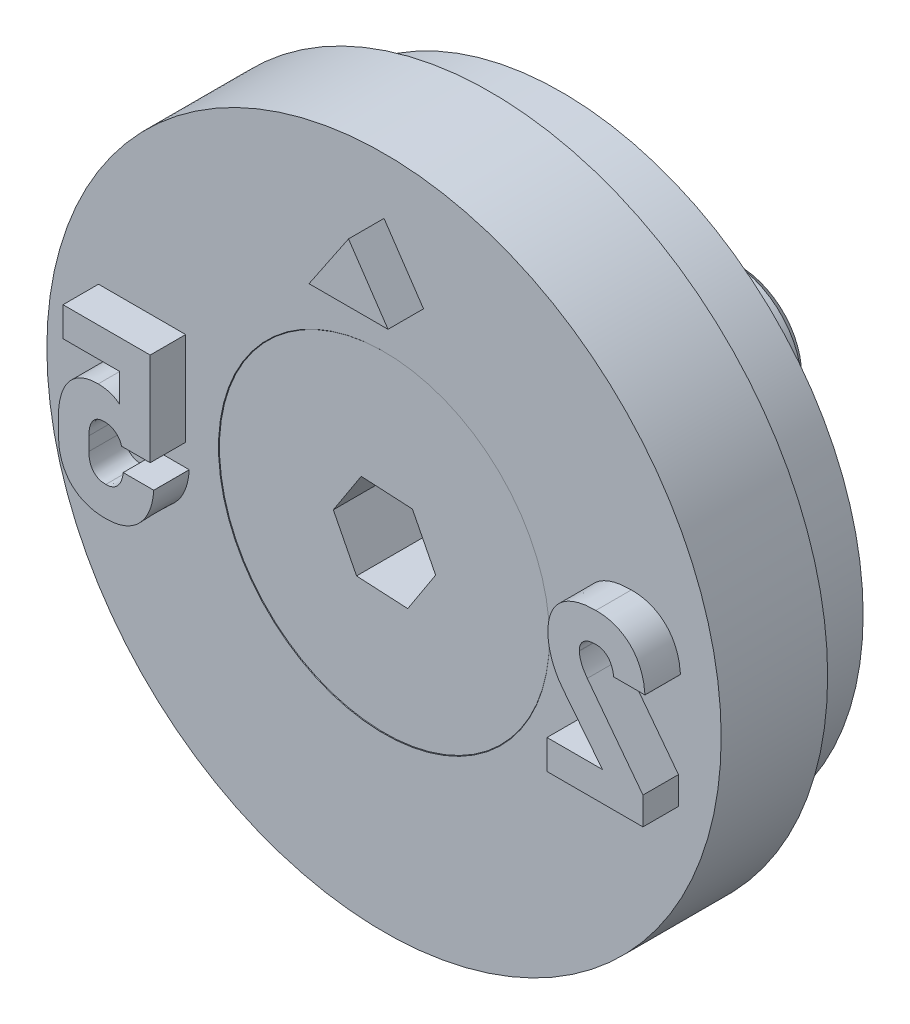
ISO-10303-21;
HEADER;
FILE_DESCRIPTION(('STEP AP214'),'2;1');
FILE_NAME('part.step','',(''),(''),'','','');
FILE_SCHEMA(('AUTOMOTIVE_DESIGN { 1 0 10303 214 1 1 1 1 }'));
ENDSEC;
DATA;
#1=APPLICATION_CONTEXT('core data for automotive mechanical design processes');
#2=APPLICATION_PROTOCOL_DEFINITION('international standard','automotive_design',2000,#1);
#3=PRODUCT_CONTEXT('',#1,'mechanical');
#4=PRODUCT('Part','Part','',(#3));
#5=PRODUCT_RELATED_PRODUCT_CATEGORY('part','',(#4));
#6=PRODUCT_DEFINITION_FORMATION('','',#4);
#7=PRODUCT_DEFINITION_CONTEXT('part definition',#1,'design');
#8=PRODUCT_DEFINITION('design','',#6,#7);
#9=PRODUCT_DEFINITION_SHAPE('','',#8);
#10=(LENGTH_UNIT() NAMED_UNIT(*) SI_UNIT(.MILLI.,.METRE.));
#11=(NAMED_UNIT(*) PLANE_ANGLE_UNIT() SI_UNIT($,.RADIAN.));
#12=(NAMED_UNIT(*) SI_UNIT($,.STERADIAN.) SOLID_ANGLE_UNIT());
#13=UNCERTAINTY_MEASURE_WITH_UNIT(LENGTH_MEASURE(1.E-05),#10,'distance_accuracy_value','');
#14=(GEOMETRIC_REPRESENTATION_CONTEXT(3) GLOBAL_UNCERTAINTY_ASSIGNED_CONTEXT((#13)) GLOBAL_UNIT_ASSIGNED_CONTEXT((#10,
#11,#12)) REPRESENTATION_CONTEXT('',''));
#15=CARTESIAN_POINT('',(0.,0.,0.));
#16=DIRECTION('',(0.,0.,1.));
#17=DIRECTION('',(1.,0.,0.));
#18=AXIS2_PLACEMENT_3D('',#15,#16,#17);
#19=CARTESIAN_POINT('',(0.,0.,-0.0130000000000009));
#20=DIRECTION('',(0.,0.,1.));
#21=DIRECTION('',(1.,0.,0.));
#22=AXIS2_PLACEMENT_3D('',#19,#20,#21);
#23=CYLINDRICAL_SURFACE('',#22,2.);
#24=CARTESIAN_POINT('',(0.,0.,-2.663));
#25=DIRECTION('',(0.,0.,1.));
#26=DIRECTION('',(1.,0.,0.));
#27=AXIS2_PLACEMENT_3D('',#24,#25,#26);
#28=CIRCLE('',#27,2.);
#29=CARTESIAN_POINT('',(2.,0.,-2.663));
#30=VERTEX_POINT('',#29);
#31=EDGE_CURVE('E12',#30,#30,#28,.T.);
#32=ORIENTED_EDGE('',*,*,#31,.F.);
#33=EDGE_LOOP('',(#32));
#34=FACE_BOUND('',#33,.T.);
#35=CARTESIAN_POINT('',(0.,0.,-9.763));
#36=DIRECTION('',(0.,0.,1.));
#37=DIRECTION('',(1.,0.,0.));
#38=AXIS2_PLACEMENT_3D('',#35,#36,#37);
#39=CIRCLE('',#38,2.);
#40=CARTESIAN_POINT('',(2.,0.,-9.763));
#41=VERTEX_POINT('',#40);
#42=EDGE_CURVE('E146',#41,#41,#39,.T.);
#43=ORIENTED_EDGE('',*,*,#42,.T.);
#44=EDGE_LOOP('',(#43));
#45=FACE_BOUND('',#44,.T.);
#46=ADVANCED_FACE('F45',(#34,#45),#23,.T.);
#47=CARTESIAN_POINT('',(0.,0.,-2.663));
#48=DIRECTION('',(0.,0.,1.));
#49=DIRECTION('',(1.,0.,0.));
#50=AXIS2_PLACEMENT_3D('',#47,#48,#49);
#51=CONICAL_SURFACE('',#50,2.,0.785398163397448);
#52=CARTESIAN_POINT('',(0.,0.,-0.0130000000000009));
#53=DIRECTION('',(0.,0.,1.));
#54=DIRECTION('',(1.,0.,0.));
#55=AXIS2_PLACEMENT_3D('',#52,#53,#54);
#56=CIRCLE('',#55,4.65);
#57=CARTESIAN_POINT('',(4.65,0.,-0.0130000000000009));
#58=VERTEX_POINT('',#57);
#59=EDGE_CURVE('E52',#58,#58,#56,.T.);
#60=ORIENTED_EDGE('',*,*,#59,.F.);
#61=EDGE_LOOP('',(#60));
#62=FACE_BOUND('',#61,.T.);
#63=ORIENTED_EDGE('',*,*,#31,.T.);
#64=EDGE_LOOP('',(#63));
#65=FACE_BOUND('',#64,.T.);
#66=ADVANCED_FACE('F161',(#62,#65),#51,.T.);
#67=CARTESIAN_POINT('',(0.,4.65,-0.0130000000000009));
#68=DIRECTION('',(0.,0.,-1.));
#69=DIRECTION('',(-1.,0.,0.));
#70=AXIS2_PLACEMENT_3D('',#67,#68,#69);
#71=PLANE('',#70);
#72=DIRECTION('',(0.99860351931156,-0.0528300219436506,0.));
#73=VECTOR('',#72,1.);
#74=CARTESIAN_POINT('',(-0.786717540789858,-1.21012761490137,-0.0130000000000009));
#75=LINE('',#74,#73);
#76=CARTESIAN_POINT('',(-0.786717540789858,-1.21012761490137,-0.0130000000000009));
#77=VERTEX_POINT('',#76);
#78=CARTESIAN_POINT('',(0.654642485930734,-1.28638118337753,-0.0130000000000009));
#79=VERTEX_POINT('',#78);
#80=EDGE_CURVE('E133',#77,#79,#75,.T.);
#81=ORIENTED_EDGE('',*,*,#80,.F.);
#82=DIRECTION('',(0.453549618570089,-0.891231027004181,0.));
#83=VECTOR('',#82,1.);
#84=CARTESIAN_POINT('',(-1.44136002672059,0.0762535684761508,-0.0130000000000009));
#85=LINE('',#84,#83);
#86=CARTESIAN_POINT('',(-1.44136002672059,0.0762535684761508,-0.0130000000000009));
#87=VERTEX_POINT('',#86);
#88=EDGE_CURVE('E59',#87,#77,#85,.T.);
#89=ORIENTED_EDGE('',*,*,#88,.F.);
#90=DIRECTION('',(-0.545053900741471,-0.83840100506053,0.));
#91=VECTOR('',#90,1.);
#92=CARTESIAN_POINT('',(-0.654642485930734,1.28638118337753,-0.0130000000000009));
#93=LINE('',#92,#91);
#94=CARTESIAN_POINT('',(-0.654642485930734,1.28638118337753,-0.0130000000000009));
#95=VERTEX_POINT('',#94);
#96=EDGE_CURVE('E142',#95,#87,#93,.T.);
#97=ORIENTED_EDGE('',*,*,#96,.F.);
#98=DIRECTION('',(-0.99860351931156,0.0528300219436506,0.));
#99=VECTOR('',#98,1.);
#100=CARTESIAN_POINT('',(0.786717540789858,1.21012761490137,-0.0130000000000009));
#101=LINE('',#100,#99);
#102=CARTESIAN_POINT('',(0.786717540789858,1.21012761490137,-0.0130000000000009));
#103=VERTEX_POINT('',#102);
#104=EDGE_CURVE('E140',#103,#95,#101,.T.);
#105=ORIENTED_EDGE('',*,*,#104,.F.);
#106=DIRECTION('',(-0.45354961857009,0.891231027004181,0.));
#107=VECTOR('',#106,1.);
#108=CARTESIAN_POINT('',(1.44136002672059,-0.0762535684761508,-0.0130000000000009));
#109=LINE('',#108,#107);
#110=CARTESIAN_POINT('',(1.44136002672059,-0.0762535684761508,-0.0130000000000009));
#111=VERTEX_POINT('',#110);
#112=EDGE_CURVE('E107',#111,#103,#109,.T.);
#113=ORIENTED_EDGE('',*,*,#112,.F.);
#114=DIRECTION('',(0.545053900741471,0.83840100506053,0.));
#115=VECTOR('',#114,1.);
#116=CARTESIAN_POINT('',(0.654642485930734,-1.28638118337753,-0.0130000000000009));
#117=LINE('',#116,#115);
#118=EDGE_CURVE('E136',#79,#111,#117,.T.);
#119=ORIENTED_EDGE('',*,*,#118,.F.);
#120=EDGE_LOOP('',(#81,#89,#97,#105,#113,#119));
#121=FACE_BOUND('',#120,.T.);
#122=ORIENTED_EDGE('',*,*,#59,.T.);
#123=EDGE_LOOP('',(#122));
#124=FACE_BOUND('',#123,.T.);
#125=ADVANCED_FACE('F159',(#121,#124),#71,.F.);
#126=CARTESIAN_POINT('',(0.,0.,-10.013));
#127=DIRECTION('',(0.,0.,1.));
#128=DIRECTION('',(1.,0.,0.));
#129=AXIS2_PLACEMENT_3D('',#126,#127,#128);
#130=PLANE('',#129);
#131=CARTESIAN_POINT('',(0.,0.,-10.013));
#132=DIRECTION('',(0.,0.,1.));
#133=DIRECTION('',(1.,0.,0.));
#134=AXIS2_PLACEMENT_3D('',#131,#132,#133);
#135=CIRCLE('',#134,1.75);
#136=CARTESIAN_POINT('',(1.75,0.,-10.013));
#137=VERTEX_POINT('',#136);
#138=EDGE_CURVE('E154',#137,#137,#135,.T.);
#139=ORIENTED_EDGE('',*,*,#138,.F.);
#140=EDGE_LOOP('',(#139));
#141=FACE_BOUND('',#140,.T.);
#142=ADVANCED_FACE('F174',(#141),#130,.F.);
#143=CARTESIAN_POINT('',(0.,0.,-10.013));
#144=DIRECTION('',(0.,0.,1.));
#145=DIRECTION('',(1.,0.,0.));
#146=AXIS2_PLACEMENT_3D('',#143,#144,#145);
#147=CONICAL_SURFACE('',#146,1.75,0.78539816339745);
#148=ORIENTED_EDGE('',*,*,#42,.F.);
#149=EDGE_LOOP('',(#148));
#150=FACE_BOUND('',#149,.T.);
#151=ORIENTED_EDGE('',*,*,#138,.T.);
#152=EDGE_LOOP('',(#151));
#153=FACE_BOUND('',#152,.T.);
#154=ADVANCED_FACE('F170',(#150,#153),#147,.T.);
#155=CARTESIAN_POINT('',(-1.44136002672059,0.0762535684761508,-2.013));
#156=DIRECTION('',(-0.891231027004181,-0.453549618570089,0.));
#157=DIRECTION('',(0.453549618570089,-0.891231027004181,0.));
#158=AXIS2_PLACEMENT_3D('',#155,#156,#157);
#159=PLANE('',#158);
#160=ORIENTED_EDGE('',*,*,#88,.T.);
#161=DIRECTION('',(0.,0.,1.));
#162=VECTOR('',#161,1.);
#163=CARTESIAN_POINT('',(-0.786717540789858,-1.21012761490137,-2.013));
#164=LINE('',#163,#162);
#165=CARTESIAN_POINT('',(-0.786717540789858,-1.21012761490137,-2.013));
#166=VERTEX_POINT('',#165);
#167=EDGE_CURVE('E89',#166,#77,#164,.T.);
#168=ORIENTED_EDGE('',*,*,#167,.F.);
#169=DIRECTION('',(0.453549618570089,-0.891231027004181,0.));
#170=VECTOR('',#169,1.);
#171=CARTESIAN_POINT('',(-1.44136002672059,0.0762535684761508,-2.013));
#172=LINE('',#171,#170);
#173=CARTESIAN_POINT('',(-1.44136002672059,0.0762535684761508,-2.013));
#174=VERTEX_POINT('',#173);
#175=EDGE_CURVE('E144',#174,#166,#172,.T.);
#176=ORIENTED_EDGE('',*,*,#175,.F.);
#177=DIRECTION('',(0.,0.,1.));
#178=VECTOR('',#177,1.);
#179=CARTESIAN_POINT('',(-1.44136002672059,0.0762535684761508,-2.013));
#180=LINE('',#179,#178);
#181=EDGE_CURVE('E67',#174,#87,#180,.T.);
#182=ORIENTED_EDGE('',*,*,#181,.T.);
#183=EDGE_LOOP('',(#160,#168,#176,#182));
#184=FACE_BOUND('',#183,.T.);
#185=ADVANCED_FACE('F173',(#184),#159,.F.);
#186=CARTESIAN_POINT('',(-0.654642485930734,1.28638118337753,-2.013));
#187=DIRECTION('',(-0.83840100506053,0.545053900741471,0.));
#188=DIRECTION('',(-0.54505390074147,-0.83840100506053,0.));
#189=AXIS2_PLACEMENT_3D('',#186,#187,#188);
#190=PLANE('',#189);
#191=ORIENTED_EDGE('',*,*,#96,.T.);
#192=ORIENTED_EDGE('',*,*,#181,.F.);
#193=DIRECTION('',(-0.545053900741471,-0.83840100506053,0.));
#194=VECTOR('',#193,1.);
#195=CARTESIAN_POINT('',(-0.654642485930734,1.28638118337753,-2.013));
#196=LINE('',#195,#194);
#197=CARTESIAN_POINT('',(-0.654642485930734,1.28638118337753,-2.013));
#198=VERTEX_POINT('',#197);
#199=EDGE_CURVE('E119',#198,#174,#196,.T.);
#200=ORIENTED_EDGE('',*,*,#199,.F.);
#201=DIRECTION('',(0.,0.,1.));
#202=VECTOR('',#201,1.);
#203=CARTESIAN_POINT('',(-0.654642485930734,1.28638118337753,-2.013));
#204=LINE('',#203,#202);
#205=EDGE_CURVE('E111',#198,#95,#204,.T.);
#206=ORIENTED_EDGE('',*,*,#205,.T.);
#207=EDGE_LOOP('',(#191,#192,#200,#206));
#208=FACE_BOUND('',#207,.T.);
#209=ADVANCED_FACE('F189',(#208),#190,.F.);
#210=CARTESIAN_POINT('',(0.786717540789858,1.21012761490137,-2.013));
#211=DIRECTION('',(0.0528300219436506,0.99860351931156,0.));
#212=DIRECTION('',(-0.99860351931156,0.0528300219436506,0.));
#213=AXIS2_PLACEMENT_3D('',#210,#211,#212);
#214=PLANE('',#213);
#215=ORIENTED_EDGE('',*,*,#104,.T.);
#216=ORIENTED_EDGE('',*,*,#205,.F.);
#217=DIRECTION('',(-0.99860351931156,0.0528300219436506,0.));
#218=VECTOR('',#217,1.);
#219=CARTESIAN_POINT('',(0.786717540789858,1.21012761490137,-2.013));
#220=LINE('',#219,#218);
#221=CARTESIAN_POINT('',(0.786717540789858,1.21012761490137,-2.013));
#222=VERTEX_POINT('',#221);
#223=EDGE_CURVE('E115',#222,#198,#220,.T.);
#224=ORIENTED_EDGE('',*,*,#223,.F.);
#225=DIRECTION('',(0.,0.,1.));
#226=VECTOR('',#225,1.);
#227=CARTESIAN_POINT('',(0.786717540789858,1.21012761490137,-2.013));
#228=LINE('',#227,#226);
#229=EDGE_CURVE('E100',#222,#103,#228,.T.);
#230=ORIENTED_EDGE('',*,*,#229,.T.);
#231=EDGE_LOOP('',(#215,#216,#224,#230));
#232=FACE_BOUND('',#231,.T.);
#233=ADVANCED_FACE('F116',(#232),#214,.F.);
#234=CARTESIAN_POINT('',(1.44136002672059,-0.0762535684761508,-2.013));
#235=DIRECTION('',(0.89123102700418,0.45354961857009,0.));
#236=DIRECTION('',(-0.45354961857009,0.891231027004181,0.));
#237=AXIS2_PLACEMENT_3D('',#234,#235,#236);
#238=PLANE('',#237);
#239=ORIENTED_EDGE('',*,*,#112,.T.);
#240=ORIENTED_EDGE('',*,*,#229,.F.);
#241=DIRECTION('',(-0.45354961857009,0.891231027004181,0.));
#242=VECTOR('',#241,1.);
#243=CARTESIAN_POINT('',(1.44136002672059,-0.0762535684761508,-2.013));
#244=LINE('',#243,#242);
#245=CARTESIAN_POINT('',(1.44136002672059,-0.0762535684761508,-2.013));
#246=VERTEX_POINT('',#245);
#247=EDGE_CURVE('E104',#246,#222,#244,.T.);
#248=ORIENTED_EDGE('',*,*,#247,.F.);
#249=DIRECTION('',(0.,0.,1.));
#250=VECTOR('',#249,1.);
#251=CARTESIAN_POINT('',(1.44136002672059,-0.0762535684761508,-2.013));
#252=LINE('',#251,#250);
#253=EDGE_CURVE('E112',#246,#111,#252,.T.);
#254=ORIENTED_EDGE('',*,*,#253,.T.);
#255=EDGE_LOOP('',(#239,#240,#248,#254));
#256=FACE_BOUND('',#255,.T.);
#257=ADVANCED_FACE('F102',(#256),#238,.F.);
#258=CARTESIAN_POINT('',(0.654642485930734,-1.28638118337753,-2.013));
#259=DIRECTION('',(0.83840100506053,-0.545053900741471,0.));
#260=DIRECTION('',(0.54505390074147,0.83840100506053,0.));
#261=AXIS2_PLACEMENT_3D('',#258,#259,#260);
#262=PLANE('',#261);
#263=ORIENTED_EDGE('',*,*,#118,.T.);
#264=ORIENTED_EDGE('',*,*,#253,.F.);
#265=DIRECTION('',(0.545053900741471,0.83840100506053,0.));
#266=VECTOR('',#265,1.);
#267=CARTESIAN_POINT('',(0.654642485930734,-1.28638118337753,-2.013));
#268=LINE('',#267,#266);
#269=CARTESIAN_POINT('',(0.654642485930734,-1.28638118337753,-2.013));
#270=VERTEX_POINT('',#269);
#271=EDGE_CURVE('E125',#270,#246,#268,.T.);
#272=ORIENTED_EDGE('',*,*,#271,.F.);
#273=DIRECTION('',(0.,0.,1.));
#274=VECTOR('',#273,1.);
#275=CARTESIAN_POINT('',(0.654642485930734,-1.28638118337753,-2.013));
#276=LINE('',#275,#274);
#277=EDGE_CURVE('E149',#270,#79,#276,.T.);
#278=ORIENTED_EDGE('',*,*,#277,.T.);
#279=EDGE_LOOP('',(#263,#264,#272,#278));
#280=FACE_BOUND('',#279,.T.);
#281=ADVANCED_FACE('F193',(#280),#262,.F.);
#282=CARTESIAN_POINT('',(-0.786717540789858,-1.21012761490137,-2.013));
#283=DIRECTION('',(-0.0528300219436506,-0.99860351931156,0.));
#284=DIRECTION('',(0.99860351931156,-0.0528300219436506,0.));
#285=AXIS2_PLACEMENT_3D('',#282,#283,#284);
#286=PLANE('',#285);
#287=ORIENTED_EDGE('',*,*,#80,.T.);
#288=ORIENTED_EDGE('',*,*,#277,.F.);
#289=DIRECTION('',(0.99860351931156,-0.0528300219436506,0.));
#290=VECTOR('',#289,1.);
#291=CARTESIAN_POINT('',(-0.786717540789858,-1.21012761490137,-2.013));
#292=LINE('',#291,#290);
#293=EDGE_CURVE('E127',#166,#270,#292,.T.);
#294=ORIENTED_EDGE('',*,*,#293,.F.);
#295=ORIENTED_EDGE('',*,*,#167,.T.);
#296=EDGE_LOOP('',(#287,#288,#294,#295));
#297=FACE_BOUND('',#296,.T.);
#298=ADVANCED_FACE('F190',(#297),#286,.F.);
#299=CARTESIAN_POINT('',(0.,0.,-2.013));
#300=DIRECTION('',(0.,0.,1.));
#301=DIRECTION('',(1.,0.,0.));
#302=AXIS2_PLACEMENT_3D('',#299,#300,#301);
#303=PLANE('',#302);
#304=ORIENTED_EDGE('',*,*,#175,.T.);
#305=ORIENTED_EDGE('',*,*,#293,.T.);
#306=ORIENTED_EDGE('',*,*,#271,.T.);
#307=ORIENTED_EDGE('',*,*,#247,.T.);
#308=ORIENTED_EDGE('',*,*,#223,.T.);
#309=ORIENTED_EDGE('',*,*,#199,.T.);
#310=EDGE_LOOP('',(#304,#305,#306,#307,#308,#309));
#311=FACE_BOUND('',#310,.T.);
#312=ADVANCED_FACE('F122',(#311),#303,.T.);
#313=CLOSED_SHELL('',(#46,#66,#125,#142,#154,#185,#209,#233,#257,#281,#298,#312));
#314=MANIFOLD_SOLID_BREP('B2',#313);
#315=CARTESIAN_POINT('',(0.,9.5,0.));
#316=DIRECTION('',(0.,0.,-1.));
#317=DIRECTION('',(-1.,0.,0.));
#318=AXIS2_PLACEMENT_3D('',#315,#316,#317);
#319=PLANE('',#318);
#320=CARTESIAN_POINT('',(-8.17590160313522,-0.930332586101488,0.));
#321=CARTESIAN_POINT('',(-8.17386058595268,-1.00154009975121,0.));
#322=CARTESIAN_POINT('',(-8.16991217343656,-1.13929329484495,0.));
#323=CARTESIAN_POINT('',(-8.14167688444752,-1.33849432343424,0.));
#324=CARTESIAN_POINT('',(-8.09077664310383,-1.52121967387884,0.));
#325=CARTESIAN_POINT('',(-8.02257781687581,-1.68865068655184,0.));
#326=CARTESIAN_POINT('',(-7.93352436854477,-1.83746020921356,0.));
#327=CARTESIAN_POINT('',(-7.82688814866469,-1.96890529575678,0.));
#328=CARTESIAN_POINT('',(-7.70072314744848,-2.07995102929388,0.));
#329=CARTESIAN_POINT('',(-7.5580069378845,-2.17340540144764,0.));
#330=CARTESIAN_POINT('',(-7.39738157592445,-2.24507840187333,0.));
#331=CARTESIAN_POINT('',(-7.22141385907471,-2.29714649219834,0.));
#332=CARTESIAN_POINT('',(-7.02940742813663,-2.32811683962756,0.));
#333=CARTESIAN_POINT('',(-6.8964422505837,-2.33167722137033,0.));
#334=CARTESIAN_POINT('',(-6.82768803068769,-2.33351823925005,0.));
#335=B_SPLINE_CURVE_WITH_KNOTS('',3,(#320,#321,#322,#323,#324,#325,#326,#327,#328,#329,#330,
#331,#332,#333,#334),.UNSPECIFIED.,.F.,.F.,(4,1,1,1,1,1,1,1,1,1,1,1,4),(0.,0.096591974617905,
0.1868602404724,0.272108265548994,0.353324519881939,0.431359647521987,0.506505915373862,
0.582010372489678,0.658435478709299,0.737063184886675,0.819709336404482,0.906774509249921,1.),.UNSPECIFIED.);
#336=CARTESIAN_POINT('',(-8.17590160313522,-0.930332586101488,0.));
#337=VERTEX_POINT('',#336);
#338=CARTESIAN_POINT('',(-6.82768803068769,-2.33351823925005,0.));
#339=VERTEX_POINT('',#338);
#340=EDGE_CURVE('E526',#337,#339,#335,.T.);
#341=ORIENTED_EDGE('',*,*,#340,.F.);
#342=DIRECTION('',(0.,-1.,0.));
#343=VECTOR('',#342,1.);
#344=CARTESIAN_POINT('',(-8.17590160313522,-0.54739148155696,0.));
#345=LINE('',#344,#343);
#346=CARTESIAN_POINT('',(-8.17590160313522,-0.547391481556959,0.));
#347=VERTEX_POINT('',#346);
#348=EDGE_CURVE('E542',#347,#337,#345,.T.);
#349=ORIENTED_EDGE('',*,*,#348,.F.);
#350=CARTESIAN_POINT('',(-7.05037154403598,0.852067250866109,0.));
#351=CARTESIAN_POINT('',(-7.10767161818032,0.850253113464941,0.));
#352=CARTESIAN_POINT('',(-7.21880408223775,0.846734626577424,0.));
#353=CARTESIAN_POINT('',(-7.37910361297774,0.815085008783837,0.));
#354=CARTESIAN_POINT('',(-7.52683452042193,0.764379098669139,0.));
#355=CARTESIAN_POINT('',(-7.66077778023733,0.691326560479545,0.));
#356=CARTESIAN_POINT('',(-7.78108490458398,0.599766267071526,0.));
#357=CARTESIAN_POINT('',(-7.88558071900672,0.487887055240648,0.));
#358=CARTESIAN_POINT('',(-7.97491663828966,0.357512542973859,0.));
#359=CARTESIAN_POINT('',(-8.04803043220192,0.208555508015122,0.));
#360=CARTESIAN_POINT('',(-8.10557406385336,0.0423212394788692,0.));
#361=CARTESIAN_POINT('',(-8.1473697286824,-0.140029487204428,0.));
#362=CARTESIAN_POINT('',(-8.17118811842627,-0.338673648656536,0.));
#363=CARTESIAN_POINT('',(-8.17429399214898,-0.476204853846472,0.));
#364=CARTESIAN_POINT('',(-8.17590160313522,-0.54739148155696,0.));
#365=B_SPLINE_CURVE_WITH_KNOTS('',3,(#350,#351,#352,#353,#354,#355,#356,#357,#358,#359,#360,
#361,#362,#363,#364),.UNSPECIFIED.,.F.,.F.,(4,1,1,1,1,1,1,1,1,1,1,1,4),(0.,0.0843949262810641,
0.16368244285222,0.239848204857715,0.3138063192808,0.3876154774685,0.461788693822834,
0.538496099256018,0.619784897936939,0.70565234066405,0.797279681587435,0.895071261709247,1.),.UNSPECIFIED.);
#366=CARTESIAN_POINT('',(-7.05037154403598,0.852067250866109,0.));
#367=VERTEX_POINT('',#366);
#368=EDGE_CURVE('E888',#367,#347,#365,.T.);
#369=ORIENTED_EDGE('',*,*,#368,.F.);
#370=CARTESIAN_POINT('',(-6.45033730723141,0.648018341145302,0.));
#371=CARTESIAN_POINT('',(-6.46768351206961,0.663377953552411,0.));
#372=CARTESIAN_POINT('',(-6.50336600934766,0.694973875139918,0.));
#373=CARTESIAN_POINT('',(-6.56574927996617,0.735091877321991,0.));
#374=CARTESIAN_POINT('',(-6.63709659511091,0.769165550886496,0.));
#375=CARTESIAN_POINT('',(-6.74237617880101,0.808409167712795,0.));
#376=CARTESIAN_POINT('',(-6.88086692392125,0.843306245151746,0.));
#377=CARTESIAN_POINT('',(-6.99455813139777,0.849182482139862,0.));
#378=CARTESIAN_POINT('',(-7.05037154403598,0.852067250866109,0.));
#379=B_SPLINE_CURVE_WITH_KNOTS('',3,(#370,#371,#372,#373,#374,#375,#376,#377,#378),
.UNSPECIFIED.,.F.,.F.,(4,1,1,1,1,1,4),(0.,0.107291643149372,0.220707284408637,0.342410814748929,
0.473179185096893,0.741372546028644,1.),.UNSPECIFIED.);
#380=CARTESIAN_POINT('',(-6.45033730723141,0.648018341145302,0.));
#381=VERTEX_POINT('',#380);
#382=EDGE_CURVE('E883',#381,#367,#379,.T.);
#383=ORIENTED_EDGE('',*,*,#382,.F.);
#384=DIRECTION('',(0.,-1.,0.));
#385=VECTOR('',#384,1.);
#386=CARTESIAN_POINT('',(-6.45033730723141,1.45582840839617,0.));
#387=LINE('',#386,#385);
#388=CARTESIAN_POINT('',(-6.45033730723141,1.45582840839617,0.));
#389=VERTEX_POINT('',#388);
#390=EDGE_CURVE('E880',#389,#381,#387,.T.);
#391=ORIENTED_EDGE('',*,*,#390,.F.);
#392=DIRECTION('',(1.,0.,0.));
#393=VECTOR('',#392,1.);
#394=CARTESIAN_POINT('',(-8.04452764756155,1.45582840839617,0.));
#395=LINE('',#394,#393);
#396=CARTESIAN_POINT('',(-8.04452764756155,1.45582840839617,0.));
#397=VERTEX_POINT('',#396);
#398=EDGE_CURVE('E877',#397,#389,#395,.T.);
#399=ORIENTED_EDGE('',*,*,#398,.F.);
#400=DIRECTION('',(0.,-1.,0.));
#401=VECTOR('',#400,1.);
#402=CARTESIAN_POINT('',(-8.04452764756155,2.286,0.));
#403=LINE('',#402,#401);
#404=CARTESIAN_POINT('',(-8.04452764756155,2.286,0.));
#405=VERTEX_POINT('',#404);
#406=EDGE_CURVE('E874',#405,#397,#403,.T.);
#407=ORIENTED_EDGE('',*,*,#406,.F.);
#408=DIRECTION('',(-1.,0.,0.));
#409=VECTOR('',#408,1.);
#410=CARTESIAN_POINT('',(-5.58848688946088,2.286,0.));
#411=LINE('',#410,#409);
#412=CARTESIAN_POINT('',(-5.58848688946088,2.286,0.));
#413=VERTEX_POINT('',#412);
#414=EDGE_CURVE('E871',#413,#405,#411,.T.);
#415=ORIENTED_EDGE('',*,*,#414,.F.);
#416=DIRECTION('',(0.,1.,0.));
#417=VECTOR('',#416,1.);
#418=CARTESIAN_POINT('',(-5.58848688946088,-0.342410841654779,0.));
#419=LINE('',#418,#417);
#420=CARTESIAN_POINT('',(-5.58848688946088,-0.34241084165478,0.));
#421=VERTEX_POINT('',#420);
#422=EDGE_CURVE('E868',#421,#413,#419,.T.);
#423=ORIENTED_EDGE('',*,*,#422,.F.);
#424=DIRECTION('',(1.,0.,0.));
#425=VECTOR('',#424,1.);
#426=CARTESIAN_POINT('',(-6.39350176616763,-0.342410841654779,0.));
#427=LINE('',#426,#425);
#428=CARTESIAN_POINT('',(-6.39350176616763,-0.34241084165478,0.));
#429=VERTEX_POINT('',#428);
#430=EDGE_CURVE('E862',#429,#421,#427,.T.);
#431=ORIENTED_EDGE('',*,*,#430,.F.);
#432=CARTESIAN_POINT('',(-6.89011395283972,0.0163052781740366,0.));
#433=CARTESIAN_POINT('',(-6.86020084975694,0.0153929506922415,0.));
#434=CARTESIAN_POINT('',(-6.80229018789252,0.0136267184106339,0.));
#435=CARTESIAN_POINT('',(-6.71890790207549,-0.00466169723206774,0.));
#436=CARTESIAN_POINT('',(-6.64227135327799,-0.0345839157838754,0.));
#437=CARTESIAN_POINT('',(-6.57325051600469,-0.0768891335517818,0.));
#438=CARTESIAN_POINT('',(-6.51229005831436,-0.128739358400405,0.));
#439=CARTESIAN_POINT('',(-6.46210048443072,-0.191391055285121,0.));
#440=CARTESIAN_POINT('',(-6.42002728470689,-0.262184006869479,0.));
#441=CARTESIAN_POINT('',(-6.40247207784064,-0.315279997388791,0.));
#442=CARTESIAN_POINT('',(-6.39350176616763,-0.342410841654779,0.));
#443=B_SPLINE_CURVE_WITH_KNOTS('',3,(#432,#433,#434,#435,#436,#437,#438,#439,#440,#441,#442),
.UNSPECIFIED.,.F.,.F.,(4,1,1,1,1,1,1,1,4),(0.,0.135635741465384,0.262585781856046,
0.385395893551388,0.507524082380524,0.628507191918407,0.746772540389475,0.870606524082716,1.),.UNSPECIFIED.);
#444=CARTESIAN_POINT('',(-6.89011395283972,0.0163052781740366,0.));
#445=VERTEX_POINT('',#444);
#446=EDGE_CURVE('E854',#445,#429,#443,.T.);
#447=ORIENTED_EDGE('',*,*,#446,.F.);
#448=CARTESIAN_POINT('',(-7.31498291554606,-0.54739148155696,0.));
#449=CARTESIAN_POINT('',(-7.31406273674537,-0.504728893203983,0.));
#450=CARTESIAN_POINT('',(-7.31231637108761,-0.42376149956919,0.));
#451=CARTESIAN_POINT('',(-7.29059164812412,-0.310500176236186,0.));
#452=CARTESIAN_POINT('',(-7.25681400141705,-0.211683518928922,0.));
#453=CARTESIAN_POINT('',(-7.20692912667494,-0.129652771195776,0.));
#454=CARTESIAN_POINT('',(-7.14491710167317,-0.0634412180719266,0.));
#455=CARTESIAN_POINT('',(-7.06987488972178,-0.0164152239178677,0.));
#456=CARTESIAN_POINT('',(-6.98330974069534,0.0113589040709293,0.));
#457=CARTESIAN_POINT('',(-6.92200187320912,0.0146128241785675,0.));
#458=CARTESIAN_POINT('',(-6.89011395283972,0.0163052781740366,0.));
#459=B_SPLINE_CURVE_WITH_KNOTS('',3,(#448,#449,#450,#451,#452,#453,#454,#455,#456,#457,#458),
.UNSPECIFIED.,.F.,.F.,(4,1,1,1,1,1,1,1,4),(0.,0.160198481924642,0.304033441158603,
0.431843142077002,0.550810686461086,0.662316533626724,0.769888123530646,0.880312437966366,1.),.UNSPECIFIED.);
#460=CARTESIAN_POINT('',(-7.31498291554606,-0.54739148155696,0.));
#461=VERTEX_POINT('',#460);
#462=EDGE_CURVE('E849',#461,#445,#459,.T.);
#463=ORIENTED_EDGE('',*,*,#462,.F.);
#464=DIRECTION('',(0.,1.,0.));
#465=VECTOR('',#464,1.);
#466=CARTESIAN_POINT('',(-7.31498291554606,-0.930332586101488,0.));
#467=LINE('',#466,#465);
#468=CARTESIAN_POINT('',(-7.31498291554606,-0.930332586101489,0.));
#469=VERTEX_POINT('',#468);
#470=EDGE_CURVE('E843',#469,#461,#467,.T.);
#471=ORIENTED_EDGE('',*,*,#470,.F.);
#472=CARTESIAN_POINT('',(-6.83980052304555,-1.49682453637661,0.));
#473=CARTESIAN_POINT('',(-6.87573488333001,-1.49525906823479,0.));
#474=CARTESIAN_POINT('',(-6.94446799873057,-1.49226473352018,0.));
#475=CARTESIAN_POINT('',(-7.0408088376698,-1.46336503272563,0.));
#476=CARTESIAN_POINT('',(-7.12467717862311,-1.4170964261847,0.));
#477=CARTESIAN_POINT('',(-7.19395255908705,-1.35051824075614,0.));
#478=CARTESIAN_POINT('',(-7.24921666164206,-1.26756267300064,0.));
#479=CARTESIAN_POINT('',(-7.28833576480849,-1.16822311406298,0.));
#480=CARTESIAN_POINT('',(-7.31150334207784,-1.05407609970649,0.));
#481=CARTESIAN_POINT('',(-7.31378320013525,-0.972997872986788,0.));
#482=CARTESIAN_POINT('',(-7.31498291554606,-0.930332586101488,0.));
#483=B_SPLINE_CURVE_WITH_KNOTS('',3,(#472,#473,#474,#475,#476,#477,#478,#479,#480,#481,#482),
.UNSPECIFIED.,.F.,.F.,(4,1,1,1,1,1,1,1,4),(0.,0.128261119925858,0.245330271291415,
0.356275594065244,0.467886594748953,0.585607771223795,0.710231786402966,0.847517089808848,1.),.UNSPECIFIED.);
#484=CARTESIAN_POINT('',(-6.83980052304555,-1.49682453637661,0.));
#485=VERTEX_POINT('',#484);
#486=EDGE_CURVE('E835',#485,#469,#483,.T.);
#487=ORIENTED_EDGE('',*,*,#486,.F.);
#488=CARTESIAN_POINT('',(-6.34971044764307,-0.964806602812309,0.));
#489=CARTESIAN_POINT('',(-6.35463050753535,-1.00482385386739,0.));
#490=CARTESIAN_POINT('',(-6.36400686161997,-1.08108632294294,0.));
#491=CARTESIAN_POINT('',(-6.39781804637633,-1.18691689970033,0.));
#492=CARTESIAN_POINT('',(-6.4419607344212,-1.27994144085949,0.));
#493=CARTESIAN_POINT('',(-6.50026975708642,-1.35799728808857,0.));
#494=CARTESIAN_POINT('',(-6.56951200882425,-1.42136751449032,0.));
#495=CARTESIAN_POINT('',(-6.65156177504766,-1.46434671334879,0.));
#496=CARTESIAN_POINT('',(-6.74224339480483,-1.49302627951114,0.));
#497=CARTESIAN_POINT('',(-6.80664815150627,-1.49553379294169,0.));
#498=CARTESIAN_POINT('',(-6.83980052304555,-1.49682453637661,0.));
#499=B_SPLINE_CURVE_WITH_KNOTS('',3,(#488,#489,#490,#491,#492,#493,#494,#495,#496,#497,#498),
.UNSPECIFIED.,.F.,.F.,(4,1,1,1,1,1,1,1,4),(0.,0.150277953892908,0.286390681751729,
0.412971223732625,0.533144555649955,0.648163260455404,0.760273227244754,0.876600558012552,1.),.UNSPECIFIED.);
#500=CARTESIAN_POINT('',(-6.34971044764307,-0.964806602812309,0.));
#501=VERTEX_POINT('',#500);
#502=EDGE_CURVE('E830',#501,#485,#499,.T.);
#503=ORIENTED_EDGE('',*,*,#502,.F.);
#504=DIRECTION('',(0.,-1.,0.));
#505=VECTOR('',#504,1.);
#506=CARTESIAN_POINT('',(-6.34971044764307,-0.962011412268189,0.));
#507=LINE('',#506,#505);
#508=CARTESIAN_POINT('',(-6.34971044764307,-0.962011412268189,0.));
#509=VERTEX_POINT('',#508);
#510=EDGE_CURVE('E827',#509,#501,#507,.T.);
#511=ORIENTED_EDGE('',*,*,#510,.F.);
#512=DIRECTION('',(-1.,0.,0.));
#513=VECTOR('',#512,1.);
#514=CARTESIAN_POINT('',(-5.48786002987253,-0.962011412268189,0.));
#515=LINE('',#514,#513);
#516=CARTESIAN_POINT('',(-5.48786002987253,-0.962011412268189,0.));
#517=VERTEX_POINT('',#516);
#518=EDGE_CURVE('E824',#517,#509,#515,.T.);
#519=ORIENTED_EDGE('',*,*,#518,.F.);
#520=DIRECTION('',(0.,1.,0.));
#521=VECTOR('',#520,1.);
#522=CARTESIAN_POINT('',(-5.48786002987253,-0.964806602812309,0.));
#523=LINE('',#522,#521);
#524=CARTESIAN_POINT('',(-5.48786002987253,-0.964806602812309,0.));
#525=VERTEX_POINT('',#524);
#526=EDGE_CURVE('E818',#525,#517,#523,.T.);
#527=ORIENTED_EDGE('',*,*,#526,.F.);
#528=CARTESIAN_POINT('',(-6.82768803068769,-2.33351823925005,0.));
#529=CARTESIAN_POINT('',(-6.76759828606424,-2.33168498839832,0.));
#530=CARTESIAN_POINT('',(-6.6500129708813,-2.32809763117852,0.));
#531=CARTESIAN_POINT('',(-6.47861538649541,-2.29589304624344,0.));
#532=CARTESIAN_POINT('',(-6.31612490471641,-2.24601841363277,0.));
#533=CARTESIAN_POINT('',(-6.16374980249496,-2.17486885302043,0.));
#534=CARTESIAN_POINT('',(-6.02314579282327,-2.08447545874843,0.));
#535=CARTESIAN_POINT('',(-5.89742134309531,-1.97393991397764,0.));
#536=CARTESIAN_POINT('',(-5.78542326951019,-1.84615623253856,0.));
#537=CARTESIAN_POINT('',(-5.68939741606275,-1.70000583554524,0.));
#538=CARTESIAN_POINT('',(-5.61031626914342,-1.53705222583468,0.));
#539=CARTESIAN_POINT('',(-5.54875021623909,-1.3592159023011,0.));
#540=CARTESIAN_POINT('',(-5.50646423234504,-1.1668165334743,0.));
#541=CARTESIAN_POINT('',(-5.49417102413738,-1.03333324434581,0.));
#542=CARTESIAN_POINT('',(-5.48786002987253,-0.964806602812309,0.));
#543=B_SPLINE_CURVE_WITH_KNOTS('',3,(#528,#529,#530,#531,#532,#533,#534,#535,#536,#537,#538,
#539,#540,#541,#542),.UNSPECIFIED.,.F.,.F.,(4,1,1,1,1,1,1,1,1,1,1,1,4),(0.,0.0844304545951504,
0.165215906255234,0.244369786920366,0.322918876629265,0.400936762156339,0.47863123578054,
0.557558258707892,0.639203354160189,0.723781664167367,0.811629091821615,0.903295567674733,1.),.UNSPECIFIED.);
#544=EDGE_CURVE('E529',#339,#525,#543,.T.);
#545=ORIENTED_EDGE('',*,*,#544,.F.);
#546=EDGE_LOOP('',(#341,#349,#369,#383,#391,#399,#407,#415,#423,#431,#447,#463,#471,#487,#503,
#511,#519,#527,#545));
#547=FACE_BOUND('',#546,.T.);
#548=CARTESIAN_POINT('',(0.,0.,0.));
#549=DIRECTION('',(0.,0.,1.));
#550=DIRECTION('',(1.,0.,0.));
#551=AXIS2_PLACEMENT_3D('',#548,#549,#550);
#552=CIRCLE('',#551,9.5);
#553=CARTESIAN_POINT('',(9.5,0.,0.));
#554=VERTEX_POINT('',#553);
#555=EDGE_CURVE('E43',#554,#554,#552,.T.);
#556=ORIENTED_EDGE('',*,*,#555,.T.);
#557=EDGE_LOOP('',(#556));
#558=FACE_BOUND('',#557,.T.);
#559=CARTESIAN_POINT('',(0.,0.,0.));
#560=DIRECTION('',(0.,0.,1.));
#561=DIRECTION('',(1.,0.,0.));
#562=AXIS2_PLACEMENT_3D('',#559,#560,#561);
#563=CIRCLE('',#562,4.663);
#564=CARTESIAN_POINT('',(4.663,0.,0.));
#565=VERTEX_POINT('',#564);
#566=EDGE_CURVE('E265',#565,#565,#563,.T.);
#567=ORIENTED_EDGE('',*,*,#566,.F.);
#568=EDGE_LOOP('',(#567));
#569=FACE_BOUND('',#568,.T.);
#570=DIRECTION('',(0.,1.,0.));
#571=VECTOR('',#570,1.);
#572=CARTESIAN_POINT('',(8.29615627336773,-2.286,0.));
#573=LINE('',#572,#571);
#574=CARTESIAN_POINT('',(8.29615627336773,-2.286,0.));
#575=VERTEX_POINT('',#574);
#576=CARTESIAN_POINT('',(8.29615627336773,-1.50893702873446,0.));
#577=VERTEX_POINT('',#576);
#578=EDGE_CURVE('E605',#575,#577,#573,.T.);
#579=ORIENTED_EDGE('',*,*,#578,.F.);
#580=DIRECTION('',(1.,0.,0.));
#581=VECTOR('',#580,1.);
#582=CARTESIAN_POINT('',(5.5922752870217,-2.286,0.));
#583=LINE('',#582,#581);
#584=CARTESIAN_POINT('',(5.5922752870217,-2.286,0.));
#585=VERTEX_POINT('',#584);
#586=EDGE_CURVE('E684',#585,#575,#583,.T.);
#587=ORIENTED_EDGE('',*,*,#586,.F.);
#588=DIRECTION('',(0.,-1.,0.));
#589=VECTOR('',#588,1.);
#590=CARTESIAN_POINT('',(5.5922752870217,-1.45582840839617,0.));
#591=LINE('',#590,#589);
#592=CARTESIAN_POINT('',(5.5922752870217,-1.45582840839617,0.));
#593=VERTEX_POINT('',#592);
#594=EDGE_CURVE('E681',#593,#585,#591,.T.);
#595=ORIENTED_EDGE('',*,*,#594,.F.);
#596=DIRECTION('',(-1.,0.,0.));
#597=VECTOR('',#596,1.);
#598=CARTESIAN_POINT('',(7.15478680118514,-1.45582840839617,0.));
#599=LINE('',#598,#597);
#600=CARTESIAN_POINT('',(7.15478680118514,-1.45582840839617,0.));
#601=VERTEX_POINT('',#600);
#602=EDGE_CURVE('E678',#601,#593,#599,.T.);
#603=ORIENTED_EDGE('',*,*,#602,.F.);
#604=DIRECTION('',(0.620676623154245,-0.78406666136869,0.));
#605=VECTOR('',#604,1.);
#606=CARTESIAN_POINT('',(6.02925674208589,-0.0340081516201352,0.));
#607=LINE('',#606,#605);
#608=CARTESIAN_POINT('',(6.02925674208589,-0.0340081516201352,0.));
#609=VERTEX_POINT('',#608);
#610=EDGE_CURVE('E672',#609,#601,#607,.T.);
#611=ORIENTED_EDGE('',*,*,#610,.F.);
#612=CARTESIAN_POINT('',(5.61743200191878,1.13810841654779,0.));
#613=CARTESIAN_POINT('',(5.61862651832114,1.08617657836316,0.));
#614=CARTESIAN_POINT('',(5.62101772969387,0.982218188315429,0.));
#615=CARTESIAN_POINT('',(5.64234424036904,0.826907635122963,0.));
#616=CARTESIAN_POINT('',(5.67721624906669,0.672494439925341,0.));
#617=CARTESIAN_POINT('',(5.72453287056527,0.519519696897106,0.));
#618=CARTESIAN_POINT('',(5.78361823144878,0.370537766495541,0.));
#619=CARTESIAN_POINT('',(5.85413254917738,0.227922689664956,0.));
#620=CARTESIAN_POINT('',(5.93463861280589,0.0920384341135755,0.));
#621=CARTESIAN_POINT('',(5.99772177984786,0.00800149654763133,0.));
#622=CARTESIAN_POINT('',(6.02925674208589,-0.0340081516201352,0.));
#623=B_SPLINE_CURVE_WITH_KNOTS('',3,(#612,#613,#614,#615,#616,#617,#618,#619,#620,#621,#622),
.UNSPECIFIED.,.F.,.F.,(4,1,1,1,1,1,1,1,4),(0.,0.123148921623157,0.24652244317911,
0.371108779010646,0.498350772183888,0.625999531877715,0.750879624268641,0.875465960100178,1.),.UNSPECIFIED.);
#624=CARTESIAN_POINT('',(5.61743200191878,1.13810841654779,0.));
#625=VERTEX_POINT('',#624);
#626=EDGE_CURVE('E667',#625,#609,#623,.T.);
#627=ORIENTED_EDGE('',*,*,#626,.F.);
#628=DIRECTION('',(0.,-1.,0.));
#629=VECTOR('',#628,1.);
#630=CARTESIAN_POINT('',(5.61743200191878,1.14183533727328,0.));
#631=LINE('',#630,#629);
#632=CARTESIAN_POINT('',(5.61743200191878,1.14183533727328,0.));
#633=VERTEX_POINT('',#632);
#634=EDGE_CURVE('E661',#633,#625,#631,.T.);
#635=ORIENTED_EDGE('',*,*,#634,.F.);
#636=CARTESIAN_POINT('',(6.9693724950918,2.33351823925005,0.));
#637=CARTESIAN_POINT('',(6.90064951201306,2.33208156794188,0.));
#638=CARTESIAN_POINT('',(6.76764037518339,2.32930097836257,0.));
#639=CARTESIAN_POINT('',(6.57611615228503,2.30312490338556,0.));
#640=CARTESIAN_POINT('',(6.40000631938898,2.25956490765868,0.));
#641=CARTESIAN_POINT('',(6.2397526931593,2.19836482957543,0.));
#642=CARTESIAN_POINT('',(6.09640758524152,2.11969362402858,0.));
#643=CARTESIAN_POINT('',(5.96930758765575,2.02631221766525,0.));
#644=CARTESIAN_POINT('',(5.86204133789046,1.91459553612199,0.));
#645=CARTESIAN_POINT('',(5.77281699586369,1.78768371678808,0.));
#646=CARTESIAN_POINT('',(5.70248086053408,1.64606647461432,0.));
#647=CARTESIAN_POINT('',(5.65322469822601,1.48986595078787,0.));
#648=CARTESIAN_POINT('',(5.62305990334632,1.3203368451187,0.));
#649=CARTESIAN_POINT('',(5.61934553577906,1.20252735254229,0.));
#650=CARTESIAN_POINT('',(5.61743200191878,1.14183533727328,0.));
#651=B_SPLINE_CURVE_WITH_KNOTS('',3,(#636,#637,#638,#639,#640,#641,#642,#643,#644,#645,#646,
#647,#648,#649,#650),.UNSPECIFIED.,.F.,.F.,(4,1,1,1,1,1,1,1,1,1,1,1,4),(0.,0.100715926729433,
0.194929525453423,0.2827284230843,0.366191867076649,0.44566981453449,0.521804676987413,
0.596515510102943,0.671682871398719,0.748455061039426,0.827368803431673,0.911065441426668,1.),.UNSPECIFIED.);
#652=CARTESIAN_POINT('',(6.9693724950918,2.33351823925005,0.));
#653=VERTEX_POINT('',#652);
#654=EDGE_CURVE('E653',#653,#633,#651,.T.);
#655=ORIENTED_EDGE('',*,*,#654,.F.);
#656=CARTESIAN_POINT('',(8.35299181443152,0.965738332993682,0.));
#657=CARTESIAN_POINT('',(8.34666301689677,1.0345689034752,0.));
#658=CARTESIAN_POINT('',(8.33433413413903,1.16865504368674,0.));
#659=CARTESIAN_POINT('',(8.29241244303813,1.36148165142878,0.));
#660=CARTESIAN_POINT('',(8.23048194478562,1.53891106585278,0.));
#661=CARTESIAN_POINT('',(8.15135713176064,1.70143301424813,0.));
#662=CARTESIAN_POINT('',(8.05433631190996,1.84699580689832,0.));
#663=CARTESIAN_POINT('',(7.94176329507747,1.97556020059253,0.));
#664=CARTESIAN_POINT('',(7.81239126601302,2.08462899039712,0.));
#665=CARTESIAN_POINT('',(7.66846112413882,2.17526096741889,0.));
#666=CARTESIAN_POINT('',(7.51060152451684,2.24618966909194,0.));
#667=CARTESIAN_POINT('',(7.34074301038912,2.29786894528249,0.));
#668=CARTESIAN_POINT('',(7.15862975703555,2.32766147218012,0.));
#669=CARTESIAN_POINT('',(7.03345982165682,2.33153498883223,0.));
#670=CARTESIAN_POINT('',(6.9693724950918,2.33351823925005,0.));
#671=B_SPLINE_CURVE_WITH_KNOTS('',3,(#656,#657,#658,#659,#660,#661,#662,#663,#664,#665,#666,
#667,#668,#669,#670),.UNSPECIFIED.,.F.,.F.,(4,1,1,1,1,1,1,1,1,1,1,1,4),(0.,0.0953291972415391,
0.185707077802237,0.271513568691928,0.354131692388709,0.434493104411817,0.512233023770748,
0.58917600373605,0.667186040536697,0.746219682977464,0.827302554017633,0.911578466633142,1.),.UNSPECIFIED.);
#672=CARTESIAN_POINT('',(8.35299181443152,0.965738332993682,0.));
#673=VERTEX_POINT('',#672);
#674=EDGE_CURVE('E648',#673,#653,#671,.T.);
#675=ORIENTED_EDGE('',*,*,#674,.F.);
#676=DIRECTION('',(0.,1.,0.));
#677=VECTOR('',#676,1.);
#678=CARTESIAN_POINT('',(8.35299181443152,0.962011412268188,0.));
#679=LINE('',#678,#677);
#680=CARTESIAN_POINT('',(8.35299181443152,0.962011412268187,0.));
#681=VERTEX_POINT('',#680);
#682=EDGE_CURVE('E645',#681,#673,#679,.T.);
#683=ORIENTED_EDGE('',*,*,#682,.F.);
#684=DIRECTION('',(1.,0.,0.));
#685=VECTOR('',#684,1.);
#686=CARTESIAN_POINT('',(7.4697116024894,0.962011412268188,0.));
#687=LINE('',#686,#685);
#688=CARTESIAN_POINT('',(7.4697116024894,0.962011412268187,0.));
#689=VERTEX_POINT('',#688);
#690=EDGE_CURVE('E642',#689,#681,#687,.T.);
#691=ORIENTED_EDGE('',*,*,#690,.F.);
#692=DIRECTION('',(0.,-1.,0.));
#693=VECTOR('',#692,1.);
#694=CARTESIAN_POINT('',(7.4697116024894,0.965738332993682,0.));
#695=LINE('',#694,#693);
#696=CARTESIAN_POINT('',(7.4697116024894,0.965738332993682,0.));
#697=VERTEX_POINT('',#696);
#698=EDGE_CURVE('E636',#697,#689,#695,.T.);
#699=ORIENTED_EDGE('',*,*,#698,.F.);
#700=CARTESIAN_POINT('',(6.96285038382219,1.50334664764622,0.));
#701=CARTESIAN_POINT('',(6.99687614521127,1.50190936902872,0.));
#702=CARTESIAN_POINT('',(7.06290937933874,1.4991200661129,0.));
#703=CARTESIAN_POINT('',(7.15684214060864,1.47254081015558,0.));
#704=CARTESIAN_POINT('',(7.24028579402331,1.42741685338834,0.));
#705=CARTESIAN_POINT('',(7.31251977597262,1.36505446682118,0.));
#706=CARTESIAN_POINT('',(7.37313063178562,1.28660246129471,0.));
#707=CARTESIAN_POINT('',(7.41780533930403,1.19209335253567,0.));
#708=CARTESIAN_POINT('',(7.4537826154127,1.08467972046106,0.));
#709=CARTESIAN_POINT('',(7.46422316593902,1.0067203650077,0.));
#710=CARTESIAN_POINT('',(7.4697116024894,0.965738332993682,0.));
#711=B_SPLINE_CURVE_WITH_KNOTS('',3,(#700,#701,#702,#703,#704,#705,#706,#707,#708,#709,#710),
.UNSPECIFIED.,.F.,.F.,(4,1,1,1,1,1,1,1,4),(0.,0.124212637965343,0.241057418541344,
0.353359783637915,0.468536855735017,0.587568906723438,0.713021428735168,0.849139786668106,1.),.UNSPECIFIED.);
#712=CARTESIAN_POINT('',(6.96285038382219,1.50334664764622,0.));
#713=VERTEX_POINT('',#712);
#714=EDGE_CURVE('E628',#713,#697,#711,.T.);
#715=ORIENTED_EDGE('',*,*,#714,.F.);
#716=CARTESIAN_POINT('',(6.5044391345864,1.1166786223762,0.));
#717=CARTESIAN_POINT('',(6.50568954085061,1.14603676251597,0.));
#718=CARTESIAN_POINT('',(6.50807239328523,1.20198347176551,0.));
#719=CARTESIAN_POINT('',(6.53107667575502,1.28069475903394,0.));
#720=CARTESIAN_POINT('',(6.56911664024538,1.34875851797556,0.));
#721=CARTESIAN_POINT('',(6.62240031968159,1.40581525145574,0.));
#722=CARTESIAN_POINT('',(6.69017748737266,1.44966598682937,0.));
#723=CARTESIAN_POINT('',(6.77012495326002,1.48169861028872,0.));
#724=CARTESIAN_POINT('',(6.86266757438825,1.49982306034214,0.));
#725=CARTESIAN_POINT('',(6.9282961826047,1.50213132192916,0.));
#726=CARTESIAN_POINT('',(6.96285038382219,1.50334664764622,0.));
#727=B_SPLINE_CURVE_WITH_KNOTS('',3,(#716,#717,#718,#719,#720,#721,#722,#723,#724,#725,#726),
.UNSPECIFIED.,.F.,.F.,(4,1,1,1,1,1,1,1,4),(0.,0.129170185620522,0.246154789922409,
0.35773418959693,0.470108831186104,0.586692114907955,0.710769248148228,0.847716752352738,1.),.UNSPECIFIED.);
#728=CARTESIAN_POINT('',(6.5044391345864,1.1166786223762,0.));
#729=VERTEX_POINT('',#728);
#730=EDGE_CURVE('E623',#729,#713,#727,.T.);
#731=ORIENTED_EDGE('',*,*,#730,.F.);
#732=DIRECTION('',(0.,1.,0.));
#733=VECTOR('',#732,1.);
#734=CARTESIAN_POINT('',(6.5044391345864,1.11015651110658,0.));
#735=LINE('',#734,#733);
#736=CARTESIAN_POINT('',(6.5044391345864,1.11015651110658,0.));
#737=VERTEX_POINT('',#736);
#738=EDGE_CURVE('E617',#737,#729,#735,.T.);
#739=ORIENTED_EDGE('',*,*,#738,.F.);
#740=CARTESIAN_POINT('',(6.72712264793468,0.553913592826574,0.));
#741=CARTESIAN_POINT('',(6.69421575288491,0.599568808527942,0.));
#742=CARTESIAN_POINT('',(6.62997464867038,0.688697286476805,0.));
#743=CARTESIAN_POINT('',(6.57249871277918,0.811630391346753,0.));
#744=CARTESIAN_POINT('',(6.53598612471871,0.908022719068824,0.));
#745=CARTESIAN_POINT('',(6.519105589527,0.977944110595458,0.));
#746=CARTESIAN_POINT('',(6.50660932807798,1.04480473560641,0.));
#747=CARTESIAN_POINT('',(6.50515258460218,1.08867214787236,0.));
#748=CARTESIAN_POINT('',(6.5044391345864,1.11015651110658,0.));
#749=B_SPLINE_CURVE_WITH_KNOTS('',3,(#740,#741,#742,#743,#744,#745,#746,#747,#748),
.UNSPECIFIED.,.F.,.F.,(4,1,1,1,1,1,4),(0.,0.276737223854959,0.540248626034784,0.665633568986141,
0.784034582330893,0.894229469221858,1.),.UNSPECIFIED.);
#750=CARTESIAN_POINT('',(6.72712264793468,0.553913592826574,0.));
#751=VERTEX_POINT('',#750);
#752=EDGE_CURVE('E612',#751,#737,#749,.T.);
#753=ORIENTED_EDGE('',*,*,#752,.F.);
#754=DIRECTION('',(-0.60539313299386,0.795926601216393,0.));
#755=VECTOR('',#754,1.);
#756=CARTESIAN_POINT('',(8.29615627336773,-1.50893702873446,0.));
#757=LINE('',#756,#755);
#758=EDGE_CURVE('E608',#577,#751,#757,.T.);
#759=ORIENTED_EDGE('',*,*,#758,.F.);
#760=EDGE_LOOP('',(#579,#587,#595,#603,#611,#627,#635,#655,#675,#683,#691,#699,#715,#731,#739,
#753,#759));
#761=FACE_BOUND('',#760,.T.);
#762=DIRECTION('',(-0.559192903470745,0.829037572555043,0.));
#763=VECTOR('',#762,1.);
#764=CARTESIAN_POINT('',(1.11293905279,6.264516,0.));
#765=LINE('',#764,#763);
#766=CARTESIAN_POINT('',(1.11293905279,6.264516,0.));
#767=VERTEX_POINT('',#766);
#768=CARTESIAN_POINT('',(0.,7.914516,0.));
#769=VERTEX_POINT('',#768);
#770=EDGE_CURVE('E525',#767,#769,#765,.T.);
#771=ORIENTED_EDGE('',*,*,#770,.F.);
#772=DIRECTION('',(1.,0.,0.));
#773=VECTOR('',#772,1.);
#774=CARTESIAN_POINT('',(-1.11293905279,6.264516,0.));
#775=LINE('',#774,#773);
#776=CARTESIAN_POINT('',(-1.11293905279,6.264516,0.));
#777=VERTEX_POINT('',#776);
#778=EDGE_CURVE('E276',#777,#767,#775,.T.);
#779=ORIENTED_EDGE('',*,*,#778,.F.);
#780=DIRECTION('',(-0.559192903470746,-0.829037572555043,0.));
#781=VECTOR('',#780,1.);
#782=CARTESIAN_POINT('',(0.,7.914516,0.));
#783=LINE('',#782,#781);
#784=EDGE_CURVE('E272',#769,#777,#783,.T.);
#785=ORIENTED_EDGE('',*,*,#784,.F.);
#786=EDGE_LOOP('',(#771,#779,#785));
#787=FACE_BOUND('',#786,.T.);
#788=ADVANCED_FACE('F257',(#547,#558,#569,#761,#787),#319,.F.);
#789=CARTESIAN_POINT('',(0.,0.,3.12219627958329));
#790=DIRECTION('',(0.,0.,1.));
#791=DIRECTION('',(1.,0.,0.));
#792=AXIS2_PLACEMENT_3D('',#789,#790,#791);
#793=CYLINDRICAL_SURFACE('',#792,9.5);
#794=ORIENTED_EDGE('',*,*,#555,.F.);
#795=EDGE_LOOP('',(#794));
#796=FACE_BOUND('',#795,.T.);
#797=CARTESIAN_POINT('',(0.,0.,-3.));
#798=DIRECTION('',(0.,0.,1.));
#799=DIRECTION('',(1.,0.,0.));
#800=AXIS2_PLACEMENT_3D('',#797,#798,#799);
#801=CIRCLE('',#800,9.5);
#802=CARTESIAN_POINT('',(9.5,0.,-3.));
#803=VERTEX_POINT('',#802);
#804=EDGE_CURVE('E738',#803,#803,#801,.T.);
#805=ORIENTED_EDGE('',*,*,#804,.T.);
#806=EDGE_LOOP('',(#805));
#807=FACE_BOUND('',#806,.T.);
#808=ADVANCED_FACE('F259',(#796,#807),#793,.T.);
#809=CARTESIAN_POINT('',(0.,0.,0.));
#810=DIRECTION('',(0.,0.,1.));
#811=DIRECTION('',(1.,0.,0.));
#812=AXIS2_PLACEMENT_3D('',#809,#810,#811);
#813=CONICAL_SURFACE('',#812,4.663,0.785398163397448);
#814=CARTESIAN_POINT('',(0.,0.,-2.663));
#815=DIRECTION('',(0.,0.,1.));
#816=DIRECTION('',(1.,0.,0.));
#817=AXIS2_PLACEMENT_3D('',#814,#815,#816);
#818=CIRCLE('',#817,2.);
#819=CARTESIAN_POINT('',(2.,0.,-2.663));
#820=VERTEX_POINT('',#819);
#821=EDGE_CURVE('E750',#820,#820,#818,.T.);
#822=ORIENTED_EDGE('',*,*,#821,.F.);
#823=EDGE_LOOP('',(#822));
#824=FACE_BOUND('',#823,.T.);
#825=ORIENTED_EDGE('',*,*,#566,.T.);
#826=EDGE_LOOP('',(#825));
#827=FACE_BOUND('',#826,.T.);
#828=ADVANCED_FACE('F755',(#824,#827),#813,.F.);
#829=CARTESIAN_POINT('',(0.,0.,3.12219627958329));
#830=DIRECTION('',(0.,0.,1.));
#831=DIRECTION('',(1.,0.,0.));
#832=AXIS2_PLACEMENT_3D('',#829,#830,#831);
#833=CYLINDRICAL_SURFACE('',#832,2.);
#834=CARTESIAN_POINT('',(0.,0.,-5.));
#835=DIRECTION('',(0.,0.,1.));
#836=DIRECTION('',(1.,0.,0.));
#837=AXIS2_PLACEMENT_3D('',#834,#835,#836);
#838=CIRCLE('',#837,2.);
#839=CARTESIAN_POINT('',(2.,0.,-5.));
#840=VERTEX_POINT('',#839);
#841=EDGE_CURVE('E747',#840,#840,#838,.T.);
#842=ORIENTED_EDGE('',*,*,#841,.F.);
#843=EDGE_LOOP('',(#842));
#844=FACE_BOUND('',#843,.T.);
#845=ORIENTED_EDGE('',*,*,#821,.T.);
#846=EDGE_LOOP('',(#845));
#847=FACE_BOUND('',#846,.T.);
#848=ADVANCED_FACE('F997',(#844,#847),#833,.F.);
#849=CARTESIAN_POINT('',(0.,2.,-5.));
#850=DIRECTION('',(0.,0.,1.));
#851=DIRECTION('',(1.,0.,0.));
#852=AXIS2_PLACEMENT_3D('',#849,#850,#851);
#853=PLANE('',#852);
#854=CARTESIAN_POINT('',(0.,0.,-5.));
#855=DIRECTION('',(0.,0.,1.));
#856=DIRECTION('',(1.,0.,0.));
#857=AXIS2_PLACEMENT_3D('',#854,#855,#856);
#858=CIRCLE('',#857,8.5);
#859=CARTESIAN_POINT('',(8.5,0.,-5.));
#860=VERTEX_POINT('',#859);
#861=EDGE_CURVE('E744',#860,#860,#858,.T.);
#862=ORIENTED_EDGE('',*,*,#861,.F.);
#863=EDGE_LOOP('',(#862));
#864=FACE_BOUND('',#863,.T.);
#865=ORIENTED_EDGE('',*,*,#841,.T.);
#866=EDGE_LOOP('',(#865));
#867=FACE_BOUND('',#866,.T.);
#868=ADVANCED_FACE('F993',(#864,#867),#853,.F.);
#869=CARTESIAN_POINT('',(0.,0.,3.12219627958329));
#870=DIRECTION('',(0.,0.,1.));
#871=DIRECTION('',(1.,0.,0.));
#872=AXIS2_PLACEMENT_3D('',#869,#870,#871);
#873=CYLINDRICAL_SURFACE('',#872,8.5);
#874=CARTESIAN_POINT('',(0.,0.,-3.));
#875=DIRECTION('',(0.,0.,1.));
#876=DIRECTION('',(1.,0.,0.));
#877=AXIS2_PLACEMENT_3D('',#874,#875,#876);
#878=CIRCLE('',#877,8.5);
#879=CARTESIAN_POINT('',(8.5,0.,-3.));
#880=VERTEX_POINT('',#879);
#881=EDGE_CURVE('E741',#880,#880,#878,.T.);
#882=ORIENTED_EDGE('',*,*,#881,.F.);
#883=EDGE_LOOP('',(#882));
#884=FACE_BOUND('',#883,.T.);
#885=ORIENTED_EDGE('',*,*,#861,.T.);
#886=EDGE_LOOP('',(#885));
#887=FACE_BOUND('',#886,.T.);
#888=ADVANCED_FACE('F989',(#884,#887),#873,.T.);
#889=CARTESIAN_POINT('',(0.,8.5,-3.));
#890=DIRECTION('',(0.,0.,1.));
#891=DIRECTION('',(1.,0.,0.));
#892=AXIS2_PLACEMENT_3D('',#889,#890,#891);
#893=PLANE('',#892);
#894=ORIENTED_EDGE('',*,*,#804,.F.);
#895=EDGE_LOOP('',(#894));
#896=FACE_BOUND('',#895,.T.);
#897=ORIENTED_EDGE('',*,*,#881,.T.);
#898=EDGE_LOOP('',(#897));
#899=FACE_BOUND('',#898,.T.);
#900=ADVANCED_FACE('F985',(#896,#899),#893,.F.);
#901=CARTESIAN_POINT('',(8.29615627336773,-2.286,1.));
#902=DIRECTION('',(-1.,0.,0.));
#903=DIRECTION('',(0.,0.,1.));
#904=AXIS2_PLACEMENT_3D('',#901,#902,#903);
#905=PLANE('',#904);
#906=ORIENTED_EDGE('',*,*,#578,.T.);
#907=DIRECTION('',(0.,0.,-1.));
#908=VECTOR('',#907,1.);
#909=CARTESIAN_POINT('',(8.29615627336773,-1.50893702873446,1.));
#910=LINE('',#909,#908);
#911=CARTESIAN_POINT('',(8.29615627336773,-1.50893702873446,1.));
#912=VERTEX_POINT('',#911);
#913=EDGE_CURVE('E735',#912,#577,#910,.T.);
#914=ORIENTED_EDGE('',*,*,#913,.F.);
#915=DIRECTION('',(0.,1.,0.));
#916=VECTOR('',#915,1.);
#917=CARTESIAN_POINT('',(8.29615627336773,-2.286,1.));
#918=LINE('',#917,#916);
#919=CARTESIAN_POINT('',(8.29615627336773,-2.286,1.));
#920=VERTEX_POINT('',#919);
#921=EDGE_CURVE('E687',#920,#912,#918,.T.);
#922=ORIENTED_EDGE('',*,*,#921,.F.);
#923=DIRECTION('',(0.,0.,-1.));
#924=VECTOR('',#923,1.);
#925=CARTESIAN_POINT('',(8.29615627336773,-2.286,1.));
#926=LINE('',#925,#924);
#927=EDGE_CURVE('E604',#920,#575,#926,.T.);
#928=ORIENTED_EDGE('',*,*,#927,.T.);
#929=EDGE_LOOP('',(#906,#914,#922,#928));
#930=FACE_BOUND('',#929,.T.);
#931=ADVANCED_FACE('F981',(#930),#905,.F.);
#932=CARTESIAN_POINT('',(8.29615627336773,-1.50893702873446,1.));
#933=DIRECTION('',(-0.795926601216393,-0.60539313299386,0.));
#934=DIRECTION('',(0.60539313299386,-0.795926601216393,0.));
#935=AXIS2_PLACEMENT_3D('',#932,#933,#934);
#936=PLANE('',#935);
#937=ORIENTED_EDGE('',*,*,#758,.T.);
#938=DIRECTION('',(0.,0.,-1.));
#939=VECTOR('',#938,1.);
#940=CARTESIAN_POINT('',(6.72712264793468,0.553913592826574,1.));
#941=LINE('',#940,#939);
#942=CARTESIAN_POINT('',(6.72712264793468,0.553913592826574,1.));
#943=VERTEX_POINT('',#942);
#944=EDGE_CURVE('E732',#943,#751,#941,.T.);
#945=ORIENTED_EDGE('',*,*,#944,.F.);
#946=DIRECTION('',(-0.60539313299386,0.795926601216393,0.));
#947=VECTOR('',#946,1.);
#948=CARTESIAN_POINT('',(8.29615627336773,-1.50893702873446,1.));
#949=LINE('',#948,#947);
#950=EDGE_CURVE('E958',#912,#943,#949,.T.);
#951=ORIENTED_EDGE('',*,*,#950,.F.);
#952=ORIENTED_EDGE('',*,*,#913,.T.);
#953=EDGE_LOOP('',(#937,#945,#951,#952));
#954=FACE_BOUND('',#953,.T.);
#955=ADVANCED_FACE('F976',(#954),#936,.F.);
#956=CARTESIAN_POINT('',(6.72712264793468,0.553913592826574,1.));
#957=CARTESIAN_POINT('',(6.69421575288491,0.599568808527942,1.));
#958=CARTESIAN_POINT('',(6.62997464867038,0.688697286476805,1.));
#959=CARTESIAN_POINT('',(6.57249871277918,0.811630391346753,1.));
#960=CARTESIAN_POINT('',(6.53598612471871,0.908022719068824,1.));
#961=CARTESIAN_POINT('',(6.519105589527,0.977944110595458,1.));
#962=CARTESIAN_POINT('',(6.50660932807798,1.04480473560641,1.));
#963=CARTESIAN_POINT('',(6.50515258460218,1.08867214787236,1.));
#964=CARTESIAN_POINT('',(6.5044391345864,1.11015651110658,1.));
#965=B_SPLINE_CURVE_WITH_KNOTS('',3,(#956,#957,#958,#959,#960,#961,#962,#963,#964),
.UNSPECIFIED.,.F.,.F.,(4,1,1,1,1,1,4),(0.,0.276737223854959,0.540248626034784,0.665633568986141,
0.784034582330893,0.894229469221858,1.),.UNSPECIFIED.);
#966=DIRECTION('',(0.,0.,-1.));
#967=VECTOR('',#966,1.);
#968=SURFACE_OF_LINEAR_EXTRUSION('',#965,#967);
#969=ORIENTED_EDGE('',*,*,#752,.T.);
#970=DIRECTION('',(0.,0.,-1.));
#971=VECTOR('',#970,1.);
#972=CARTESIAN_POINT('',(6.5044391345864,1.11015651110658,1.));
#973=LINE('',#972,#971);
#974=CARTESIAN_POINT('',(6.5044391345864,1.11015651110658,1.));
#975=VERTEX_POINT('',#974);
#976=EDGE_CURVE('E729',#975,#737,#973,.T.);
#977=ORIENTED_EDGE('',*,*,#976,.F.);
#978=EDGE_CURVE('E960',#943,#975,#965,.T.);
#979=ORIENTED_EDGE('',*,*,#978,.F.);
#980=ORIENTED_EDGE('',*,*,#944,.T.);
#981=EDGE_LOOP('',(#969,#977,#979,#980));
#982=FACE_BOUND('',#981,.T.);
#983=ADVANCED_FACE('F971',(#982),#968,.F.);
#984=CARTESIAN_POINT('',(6.5044391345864,1.11015651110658,1.));
#985=DIRECTION('',(-1.,0.,0.));
#986=DIRECTION('',(0.,0.,1.));
#987=AXIS2_PLACEMENT_3D('',#984,#985,#986);
#988=PLANE('',#987);
#989=ORIENTED_EDGE('',*,*,#738,.T.);
#990=DIRECTION('',(0.,0.,-1.));
#991=VECTOR('',#990,1.);
#992=CARTESIAN_POINT('',(6.5044391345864,1.1166786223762,1.));
#993=LINE('',#992,#991);
#994=CARTESIAN_POINT('',(6.5044391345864,1.1166786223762,1.));
#995=VERTEX_POINT('',#994);
#996=EDGE_CURVE('E726',#995,#729,#993,.T.);
#997=ORIENTED_EDGE('',*,*,#996,.F.);
#998=DIRECTION('',(0.,1.,0.));
#999=VECTOR('',#998,1.);
#1000=CARTESIAN_POINT('',(6.5044391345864,1.11015651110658,1.));
#1001=LINE('',#1000,#999);
#1002=EDGE_CURVE('E965',#975,#995,#1001,.T.);
#1003=ORIENTED_EDGE('',*,*,#1002,.F.);
#1004=ORIENTED_EDGE('',*,*,#976,.T.);
#1005=EDGE_LOOP('',(#989,#997,#1003,#1004));
#1006=FACE_BOUND('',#1005,.T.);
#1007=ADVANCED_FACE('F975',(#1006),#988,.F.);
#1008=CARTESIAN_POINT('',(6.5044391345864,1.1166786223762,1.));
#1009=CARTESIAN_POINT('',(6.50568954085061,1.14603676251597,1.));
#1010=CARTESIAN_POINT('',(6.50807239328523,1.20198347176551,1.));
#1011=CARTESIAN_POINT('',(6.53107667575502,1.28069475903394,1.));
#1012=CARTESIAN_POINT('',(6.56911664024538,1.34875851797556,1.));
#1013=CARTESIAN_POINT('',(6.62240031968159,1.40581525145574,1.));
#1014=CARTESIAN_POINT('',(6.69017748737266,1.44966598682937,1.));
#1015=CARTESIAN_POINT('',(6.77012495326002,1.48169861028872,1.));
#1016=CARTESIAN_POINT('',(6.86266757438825,1.49982306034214,1.));
#1017=CARTESIAN_POINT('',(6.9282961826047,1.50213132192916,1.));
#1018=CARTESIAN_POINT('',(6.96285038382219,1.50334664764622,1.));
#1019=B_SPLINE_CURVE_WITH_KNOTS('',3,(#1008,#1009,#1010,#1011,#1012,#1013,#1014,#1015,#1016,
#1017,#1018),.UNSPECIFIED.,.F.,.F.,(4,1,1,1,1,1,1,1,4),(0.,0.129170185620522,0.246154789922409,
0.35773418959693,0.470108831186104,0.586692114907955,0.710769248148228,0.847716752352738,1.),.UNSPECIFIED.);
#1020=DIRECTION('',(0.,0.,-1.));
#1021=VECTOR('',#1020,1.);
#1022=SURFACE_OF_LINEAR_EXTRUSION('',#1019,#1021);
#1023=ORIENTED_EDGE('',*,*,#730,.T.);
#1024=DIRECTION('',(0.,0.,-1.));
#1025=VECTOR('',#1024,1.);
#1026=CARTESIAN_POINT('',(6.96285038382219,1.50334664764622,1.));
#1027=LINE('',#1026,#1025);
#1028=CARTESIAN_POINT('',(6.96285038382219,1.50334664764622,1.));
#1029=VERTEX_POINT('',#1028);
#1030=EDGE_CURVE('E723',#1029,#713,#1027,.T.);
#1031=ORIENTED_EDGE('',*,*,#1030,.F.);
#1032=EDGE_CURVE('E1512',#995,#1029,#1019,.T.);
#1033=ORIENTED_EDGE('',*,*,#1032,.F.);
#1034=ORIENTED_EDGE('',*,*,#996,.T.);
#1035=EDGE_LOOP('',(#1023,#1031,#1033,#1034));
#1036=FACE_BOUND('',#1035,.T.);
#1037=ADVANCED_FACE('F1076',(#1036),#1022,.F.);
#1038=CARTESIAN_POINT('',(6.96285038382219,1.50334664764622,1.));
#1039=CARTESIAN_POINT('',(6.99687614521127,1.50190936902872,1.));
#1040=CARTESIAN_POINT('',(7.06290937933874,1.4991200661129,1.));
#1041=CARTESIAN_POINT('',(7.15684214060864,1.47254081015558,1.));
#1042=CARTESIAN_POINT('',(7.24028579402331,1.42741685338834,1.));
#1043=CARTESIAN_POINT('',(7.31251977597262,1.36505446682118,1.));
#1044=CARTESIAN_POINT('',(7.37313063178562,1.28660246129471,1.));
#1045=CARTESIAN_POINT('',(7.41780533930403,1.19209335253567,1.));
#1046=CARTESIAN_POINT('',(7.4537826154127,1.08467972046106,1.));
#1047=CARTESIAN_POINT('',(7.46422316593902,1.0067203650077,1.));
#1048=CARTESIAN_POINT('',(7.4697116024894,0.965738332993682,1.));
#1049=B_SPLINE_CURVE_WITH_KNOTS('',3,(#1038,#1039,#1040,#1041,#1042,#1043,#1044,#1045,#1046,
#1047,#1048),.UNSPECIFIED.,.F.,.F.,(4,1,1,1,1,1,1,1,4),(0.,0.124212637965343,0.241057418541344,
0.353359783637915,0.468536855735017,0.587568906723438,0.713021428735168,0.849139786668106,1.),.UNSPECIFIED.);
#1050=DIRECTION('',(0.,0.,-1.));
#1051=VECTOR('',#1050,1.);
#1052=SURFACE_OF_LINEAR_EXTRUSION('',#1049,#1051);
#1053=ORIENTED_EDGE('',*,*,#714,.T.);
#1054=DIRECTION('',(0.,0.,-1.));
#1055=VECTOR('',#1054,1.);
#1056=CARTESIAN_POINT('',(7.4697116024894,0.965738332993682,1.));
#1057=LINE('',#1056,#1055);
#1058=CARTESIAN_POINT('',(7.4697116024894,0.965738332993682,1.));
#1059=VERTEX_POINT('',#1058);
#1060=EDGE_CURVE('E720',#1059,#697,#1057,.T.);
#1061=ORIENTED_EDGE('',*,*,#1060,.F.);
#1062=EDGE_CURVE('E1506',#1029,#1059,#1049,.T.);
#1063=ORIENTED_EDGE('',*,*,#1062,.F.);
#1064=ORIENTED_EDGE('',*,*,#1030,.T.);
#1065=EDGE_LOOP('',(#1053,#1061,#1063,#1064));
#1066=FACE_BOUND('',#1065,.T.);
#1067=ADVANCED_FACE('F1084',(#1066),#1052,.F.);
#1068=CARTESIAN_POINT('',(7.4697116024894,0.965738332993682,1.));
#1069=DIRECTION('',(1.,0.,0.));
#1070=DIRECTION('',(0.,0.,-1.));
#1071=AXIS2_PLACEMENT_3D('',#1068,#1069,#1070);
#1072=PLANE('',#1071);
#1073=ORIENTED_EDGE('',*,*,#698,.T.);
#1074=DIRECTION('',(0.,0.,-1.));
#1075=VECTOR('',#1074,1.);
#1076=CARTESIAN_POINT('',(7.4697116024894,0.962011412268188,1.));
#1077=LINE('',#1076,#1075);
#1078=CARTESIAN_POINT('',(7.4697116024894,0.962011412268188,1.));
#1079=VERTEX_POINT('',#1078);
#1080=EDGE_CURVE('E717',#1079,#689,#1077,.T.);
#1081=ORIENTED_EDGE('',*,*,#1080,.F.);
#1082=DIRECTION('',(0.,-1.,0.));
#1083=VECTOR('',#1082,1.);
#1084=CARTESIAN_POINT('',(7.4697116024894,0.965738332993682,1.));
#1085=LINE('',#1084,#1083);
#1086=EDGE_CURVE('E1511',#1059,#1079,#1085,.T.);
#1087=ORIENTED_EDGE('',*,*,#1086,.F.);
#1088=ORIENTED_EDGE('',*,*,#1060,.T.);
#1089=EDGE_LOOP('',(#1073,#1081,#1087,#1088));
#1090=FACE_BOUND('',#1089,.T.);
#1091=ADVANCED_FACE('F1092',(#1090),#1072,.F.);
#1092=CARTESIAN_POINT('',(7.4697116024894,0.962011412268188,1.));
#1093=DIRECTION('',(0.,1.,0.));
#1094=DIRECTION('',(0.,0.,1.));
#1095=AXIS2_PLACEMENT_3D('',#1092,#1093,#1094);
#1096=PLANE('',#1095);
#1097=ORIENTED_EDGE('',*,*,#690,.T.);
#1098=DIRECTION('',(0.,0.,-1.));
#1099=VECTOR('',#1098,1.);
#1100=CARTESIAN_POINT('',(8.35299181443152,0.962011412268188,1.));
#1101=LINE('',#1100,#1099);
#1102=CARTESIAN_POINT('',(8.35299181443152,0.962011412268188,1.));
#1103=VERTEX_POINT('',#1102);
#1104=EDGE_CURVE('E714',#1103,#681,#1101,.T.);
#1105=ORIENTED_EDGE('',*,*,#1104,.F.);
#1106=DIRECTION('',(1.,0.,0.));
#1107=VECTOR('',#1106,1.);
#1108=CARTESIAN_POINT('',(7.4697116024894,0.962011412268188,1.));
#1109=LINE('',#1108,#1107);
#1110=EDGE_CURVE('E1520',#1079,#1103,#1109,.T.);
#1111=ORIENTED_EDGE('',*,*,#1110,.F.);
#1112=ORIENTED_EDGE('',*,*,#1080,.T.);
#1113=EDGE_LOOP('',(#1097,#1105,#1111,#1112));
#1114=FACE_BOUND('',#1113,.T.);
#1115=ADVANCED_FACE('F1101',(#1114),#1096,.F.);
#1116=CARTESIAN_POINT('',(8.35299181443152,0.962011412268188,1.));
#1117=DIRECTION('',(-1.,0.,0.));
#1118=DIRECTION('',(0.,0.,1.));
#1119=AXIS2_PLACEMENT_3D('',#1116,#1117,#1118);
#1120=PLANE('',#1119);
#1121=ORIENTED_EDGE('',*,*,#682,.T.);
#1122=DIRECTION('',(0.,0.,-1.));
#1123=VECTOR('',#1122,1.);
#1124=CARTESIAN_POINT('',(8.35299181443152,0.965738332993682,1.));
#1125=LINE('',#1124,#1123);
#1126=CARTESIAN_POINT('',(8.35299181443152,0.965738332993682,1.));
#1127=VERTEX_POINT('',#1126);
#1128=EDGE_CURVE('E711',#1127,#673,#1125,.T.);
#1129=ORIENTED_EDGE('',*,*,#1128,.F.);
#1130=DIRECTION('',(0.,1.,0.));
#1131=VECTOR('',#1130,1.);
#1132=CARTESIAN_POINT('',(8.35299181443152,0.962011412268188,1.));
#1133=LINE('',#1132,#1131);
#1134=EDGE_CURVE('E1493',#1103,#1127,#1133,.T.);
#1135=ORIENTED_EDGE('',*,*,#1134,.F.);
#1136=ORIENTED_EDGE('',*,*,#1104,.T.);
#1137=EDGE_LOOP('',(#1121,#1129,#1135,#1136));
#1138=FACE_BOUND('',#1137,.T.);
#1139=ADVANCED_FACE('F1110',(#1138),#1120,.F.);
#1140=CARTESIAN_POINT('',(8.35299181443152,0.965738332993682,1.));
#1141=CARTESIAN_POINT('',(8.34666301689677,1.0345689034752,1.));
#1142=CARTESIAN_POINT('',(8.33433413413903,1.16865504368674,1.));
#1143=CARTESIAN_POINT('',(8.29241244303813,1.36148165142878,1.));
#1144=CARTESIAN_POINT('',(8.23048194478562,1.53891106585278,1.));
#1145=CARTESIAN_POINT('',(8.15135713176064,1.70143301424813,1.));
#1146=CARTESIAN_POINT('',(8.05433631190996,1.84699580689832,1.));
#1147=CARTESIAN_POINT('',(7.94176329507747,1.97556020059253,1.));
#1148=CARTESIAN_POINT('',(7.81239126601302,2.08462899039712,1.));
#1149=CARTESIAN_POINT('',(7.66846112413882,2.17526096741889,1.));
#1150=CARTESIAN_POINT('',(7.51060152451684,2.24618966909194,1.));
#1151=CARTESIAN_POINT('',(7.34074301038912,2.29786894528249,1.));
#1152=CARTESIAN_POINT('',(7.15862975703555,2.32766147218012,1.));
#1153=CARTESIAN_POINT('',(7.03345982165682,2.33153498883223,1.));
#1154=CARTESIAN_POINT('',(6.9693724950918,2.33351823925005,1.));
#1155=B_SPLINE_CURVE_WITH_KNOTS('',3,(#1140,#1141,#1142,#1143,#1144,#1145,#1146,#1147,#1148,
#1149,#1150,#1151,#1152,#1153,#1154),.UNSPECIFIED.,.F.,.F.,(4,1,1,1,1,1,1,1,1,1,1,1,4),(0.,
0.0953291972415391,0.185707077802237,0.271513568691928,0.354131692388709,0.434493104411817,
0.512233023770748,0.58917600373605,0.667186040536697,0.746219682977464,0.827302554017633,
0.911578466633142,1.),.UNSPECIFIED.);
#1156=DIRECTION('',(0.,0.,-1.));
#1157=VECTOR('',#1156,1.);
#1158=SURFACE_OF_LINEAR_EXTRUSION('',#1155,#1157);
#1159=ORIENTED_EDGE('',*,*,#674,.T.);
#1160=DIRECTION('',(0.,0.,-1.));
#1161=VECTOR('',#1160,1.);
#1162=CARTESIAN_POINT('',(6.9693724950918,2.33351823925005,1.));
#1163=LINE('',#1162,#1161);
#1164=CARTESIAN_POINT('',(6.9693724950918,2.33351823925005,1.));
#1165=VERTEX_POINT('',#1164);
#1166=EDGE_CURVE('E708',#1165,#653,#1163,.T.);
#1167=ORIENTED_EDGE('',*,*,#1166,.F.);
#1168=EDGE_CURVE('E1492',#1127,#1165,#1155,.T.);
#1169=ORIENTED_EDGE('',*,*,#1168,.F.);
#1170=ORIENTED_EDGE('',*,*,#1128,.T.);
#1171=EDGE_LOOP('',(#1159,#1167,#1169,#1170));
#1172=FACE_BOUND('',#1171,.T.);
#1173=ADVANCED_FACE('F1119',(#1172),#1158,.F.);
#1174=CARTESIAN_POINT('',(6.9693724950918,2.33351823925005,1.));
#1175=CARTESIAN_POINT('',(6.90064951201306,2.33208156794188,1.));
#1176=CARTESIAN_POINT('',(6.76764037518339,2.32930097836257,1.));
#1177=CARTESIAN_POINT('',(6.57611615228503,2.30312490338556,1.));
#1178=CARTESIAN_POINT('',(6.40000631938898,2.25956490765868,1.));
#1179=CARTESIAN_POINT('',(6.2397526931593,2.19836482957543,1.));
#1180=CARTESIAN_POINT('',(6.09640758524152,2.11969362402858,1.));
#1181=CARTESIAN_POINT('',(5.96930758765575,2.02631221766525,1.));
#1182=CARTESIAN_POINT('',(5.86204133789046,1.91459553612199,1.));
#1183=CARTESIAN_POINT('',(5.77281699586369,1.78768371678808,1.));
#1184=CARTESIAN_POINT('',(5.70248086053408,1.64606647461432,1.));
#1185=CARTESIAN_POINT('',(5.65322469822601,1.48986595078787,1.));
#1186=CARTESIAN_POINT('',(5.62305990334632,1.3203368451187,1.));
#1187=CARTESIAN_POINT('',(5.61934553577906,1.20252735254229,1.));
#1188=CARTESIAN_POINT('',(5.61743200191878,1.14183533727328,1.));
#1189=B_SPLINE_CURVE_WITH_KNOTS('',3,(#1174,#1175,#1176,#1177,#1178,#1179,#1180,#1181,#1182,
#1183,#1184,#1185,#1186,#1187,#1188),.UNSPECIFIED.,.F.,.F.,(4,1,1,1,1,1,1,1,1,1,1,1,4),(0.,
0.100715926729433,0.194929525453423,0.2827284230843,0.366191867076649,0.44566981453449,
0.521804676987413,0.596515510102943,0.671682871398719,0.748455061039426,0.827368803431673,
0.911065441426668,1.),.UNSPECIFIED.);
#1190=DIRECTION('',(0.,0.,-1.));
#1191=VECTOR('',#1190,1.);
#1192=SURFACE_OF_LINEAR_EXTRUSION('',#1189,#1191);
#1193=ORIENTED_EDGE('',*,*,#654,.T.);
#1194=DIRECTION('',(0.,0.,-1.));
#1195=VECTOR('',#1194,1.);
#1196=CARTESIAN_POINT('',(5.61743200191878,1.14183533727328,1.));
#1197=LINE('',#1196,#1195);
#1198=CARTESIAN_POINT('',(5.61743200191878,1.14183533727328,1.));
#1199=VERTEX_POINT('',#1198);
#1200=EDGE_CURVE('E705',#1199,#633,#1197,.T.);
#1201=ORIENTED_EDGE('',*,*,#1200,.F.);
#1202=EDGE_CURVE('E1491',#1165,#1199,#1189,.T.);
#1203=ORIENTED_EDGE('',*,*,#1202,.F.);
#1204=ORIENTED_EDGE('',*,*,#1166,.T.);
#1205=EDGE_LOOP('',(#1193,#1201,#1203,#1204));
#1206=FACE_BOUND('',#1205,.T.);
#1207=ADVANCED_FACE('F1128',(#1206),#1192,.F.);
#1208=CARTESIAN_POINT('',(5.61743200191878,1.14183533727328,1.));
#1209=DIRECTION('',(1.,0.,0.));
#1210=DIRECTION('',(0.,0.,-1.));
#1211=AXIS2_PLACEMENT_3D('',#1208,#1209,#1210);
#1212=PLANE('',#1211);
#1213=ORIENTED_EDGE('',*,*,#634,.T.);
#1214=DIRECTION('',(0.,0.,-1.));
#1215=VECTOR('',#1214,1.);
#1216=CARTESIAN_POINT('',(5.61743200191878,1.13810841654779,1.));
#1217=LINE('',#1216,#1215);
#1218=CARTESIAN_POINT('',(5.61743200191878,1.13810841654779,1.));
#1219=VERTEX_POINT('',#1218);
#1220=EDGE_CURVE('E702',#1219,#625,#1217,.T.);
#1221=ORIENTED_EDGE('',*,*,#1220,.F.);
#1222=DIRECTION('',(0.,-1.,0.));
#1223=VECTOR('',#1222,1.);
#1224=CARTESIAN_POINT('',(5.61743200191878,1.14183533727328,1.));
#1225=LINE('',#1224,#1223);
#1226=EDGE_CURVE('E592',#1199,#1219,#1225,.T.);
#1227=ORIENTED_EDGE('',*,*,#1226,.F.);
#1228=ORIENTED_EDGE('',*,*,#1200,.T.);
#1229=EDGE_LOOP('',(#1213,#1221,#1227,#1228));
#1230=FACE_BOUND('',#1229,.T.);
#1231=ADVANCED_FACE('F582',(#1230),#1212,.F.);
#1232=CARTESIAN_POINT('',(5.61743200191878,1.13810841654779,1.));
#1233=CARTESIAN_POINT('',(5.61862651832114,1.08617657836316,1.));
#1234=CARTESIAN_POINT('',(5.62101772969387,0.982218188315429,1.));
#1235=CARTESIAN_POINT('',(5.64234424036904,0.826907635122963,1.));
#1236=CARTESIAN_POINT('',(5.67721624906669,0.672494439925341,1.));
#1237=CARTESIAN_POINT('',(5.72453287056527,0.519519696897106,1.));
#1238=CARTESIAN_POINT('',(5.78361823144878,0.370537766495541,1.));
#1239=CARTESIAN_POINT('',(5.85413254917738,0.227922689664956,1.));
#1240=CARTESIAN_POINT('',(5.93463861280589,0.0920384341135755,1.));
#1241=CARTESIAN_POINT('',(5.99772177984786,0.00800149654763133,1.));
#1242=CARTESIAN_POINT('',(6.02925674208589,-0.0340081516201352,1.));
#1243=B_SPLINE_CURVE_WITH_KNOTS('',3,(#1232,#1233,#1234,#1235,#1236,#1237,#1238,#1239,#1240,
#1241,#1242),.UNSPECIFIED.,.F.,.F.,(4,1,1,1,1,1,1,1,4),(0.,0.123148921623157,0.24652244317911,
0.371108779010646,0.498350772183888,0.625999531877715,0.750879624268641,0.875465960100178,1.),.UNSPECIFIED.);
#1244=DIRECTION('',(0.,0.,-1.));
#1245=VECTOR('',#1244,1.);
#1246=SURFACE_OF_LINEAR_EXTRUSION('',#1243,#1245);
#1247=ORIENTED_EDGE('',*,*,#626,.T.);
#1248=DIRECTION('',(0.,0.,-1.));
#1249=VECTOR('',#1248,1.);
#1250=CARTESIAN_POINT('',(6.02925674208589,-0.0340081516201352,1.));
#1251=LINE('',#1250,#1249);
#1252=CARTESIAN_POINT('',(6.02925674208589,-0.0340081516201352,1.));
#1253=VERTEX_POINT('',#1252);
#1254=EDGE_CURVE('E699',#1253,#609,#1251,.T.);
#1255=ORIENTED_EDGE('',*,*,#1254,.F.);
#1256=EDGE_CURVE('E585',#1219,#1253,#1243,.T.);
#1257=ORIENTED_EDGE('',*,*,#1256,.F.);
#1258=ORIENTED_EDGE('',*,*,#1220,.T.);
#1259=EDGE_LOOP('',(#1247,#1255,#1257,#1258));
#1260=FACE_BOUND('',#1259,.T.);
#1261=ADVANCED_FACE('F577',(#1260),#1246,.F.);
#1262=CARTESIAN_POINT('',(6.02925674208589,-0.0340081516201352,1.));
#1263=DIRECTION('',(0.78406666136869,0.620676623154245,0.));
#1264=DIRECTION('',(-0.620676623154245,0.78406666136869,0.));
#1265=AXIS2_PLACEMENT_3D('',#1262,#1263,#1264);
#1266=PLANE('',#1265);
#1267=ORIENTED_EDGE('',*,*,#610,.T.);
#1268=DIRECTION('',(0.,0.,-1.));
#1269=VECTOR('',#1268,1.);
#1270=CARTESIAN_POINT('',(7.15478680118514,-1.45582840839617,1.));
#1271=LINE('',#1270,#1269);
#1272=CARTESIAN_POINT('',(7.15478680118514,-1.45582840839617,1.));
#1273=VERTEX_POINT('',#1272);
#1274=EDGE_CURVE('E696',#1273,#601,#1271,.T.);
#1275=ORIENTED_EDGE('',*,*,#1274,.F.);
#1276=DIRECTION('',(0.620676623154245,-0.78406666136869,0.));
#1277=VECTOR('',#1276,1.);
#1278=CARTESIAN_POINT('',(6.02925674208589,-0.0340081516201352,1.));
#1279=LINE('',#1278,#1277);
#1280=EDGE_CURVE('E591',#1253,#1273,#1279,.T.);
#1281=ORIENTED_EDGE('',*,*,#1280,.F.);
#1282=ORIENTED_EDGE('',*,*,#1254,.T.);
#1283=EDGE_LOOP('',(#1267,#1275,#1281,#1282));
#1284=FACE_BOUND('',#1283,.T.);
#1285=ADVANCED_FACE('F573',(#1284),#1266,.F.);
#1286=CARTESIAN_POINT('',(7.15478680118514,-1.45582840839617,1.));
#1287=DIRECTION('',(0.,-1.,0.));
#1288=DIRECTION('',(0.,0.,-1.));
#1289=AXIS2_PLACEMENT_3D('',#1286,#1287,#1288);
#1290=PLANE('',#1289);
#1291=ORIENTED_EDGE('',*,*,#602,.T.);
#1292=DIRECTION('',(0.,0.,-1.));
#1293=VECTOR('',#1292,1.);
#1294=CARTESIAN_POINT('',(5.5922752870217,-1.45582840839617,1.));
#1295=LINE('',#1294,#1293);
#1296=CARTESIAN_POINT('',(5.5922752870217,-1.45582840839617,1.));
#1297=VERTEX_POINT('',#1296);
#1298=EDGE_CURVE('E693',#1297,#593,#1295,.T.);
#1299=ORIENTED_EDGE('',*,*,#1298,.F.);
#1300=DIRECTION('',(-1.,0.,0.));
#1301=VECTOR('',#1300,1.);
#1302=CARTESIAN_POINT('',(7.15478680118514,-1.45582840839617,1.));
#1303=LINE('',#1302,#1301);
#1304=EDGE_CURVE('E598',#1273,#1297,#1303,.T.);
#1305=ORIENTED_EDGE('',*,*,#1304,.F.);
#1306=ORIENTED_EDGE('',*,*,#1274,.T.);
#1307=EDGE_LOOP('',(#1291,#1299,#1305,#1306));
#1308=FACE_BOUND('',#1307,.T.);
#1309=ADVANCED_FACE('F569',(#1308),#1290,.F.);
#1310=CARTESIAN_POINT('',(5.5922752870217,-1.45582840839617,1.));
#1311=DIRECTION('',(1.,0.,0.));
#1312=DIRECTION('',(0.,0.,-1.));
#1313=AXIS2_PLACEMENT_3D('',#1310,#1311,#1312);
#1314=PLANE('',#1313);
#1315=ORIENTED_EDGE('',*,*,#594,.T.);
#1316=DIRECTION('',(0.,0.,-1.));
#1317=VECTOR('',#1316,1.);
#1318=CARTESIAN_POINT('',(5.5922752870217,-2.286,1.));
#1319=LINE('',#1318,#1317);
#1320=CARTESIAN_POINT('',(5.5922752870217,-2.286,1.));
#1321=VERTEX_POINT('',#1320);
#1322=EDGE_CURVE('E690',#1321,#585,#1319,.T.);
#1323=ORIENTED_EDGE('',*,*,#1322,.F.);
#1324=DIRECTION('',(0.,-1.,0.));
#1325=VECTOR('',#1324,1.);
#1326=CARTESIAN_POINT('',(5.5922752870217,-1.45582840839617,1.));
#1327=LINE('',#1326,#1325);
#1328=EDGE_CURVE('E600',#1297,#1321,#1327,.T.);
#1329=ORIENTED_EDGE('',*,*,#1328,.F.);
#1330=ORIENTED_EDGE('',*,*,#1298,.T.);
#1331=EDGE_LOOP('',(#1315,#1323,#1329,#1330));
#1332=FACE_BOUND('',#1331,.T.);
#1333=ADVANCED_FACE('F565',(#1332),#1314,.F.);
#1334=CARTESIAN_POINT('',(5.5922752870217,-2.286,1.));
#1335=DIRECTION('',(0.,1.,0.));
#1336=DIRECTION('',(0.,0.,1.));
#1337=AXIS2_PLACEMENT_3D('',#1334,#1335,#1336);
#1338=PLANE('',#1337);
#1339=ORIENTED_EDGE('',*,*,#586,.T.);
#1340=ORIENTED_EDGE('',*,*,#927,.F.);
#1341=DIRECTION('',(1.,0.,0.));
#1342=VECTOR('',#1341,1.);
#1343=CARTESIAN_POINT('',(5.5922752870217,-2.286,1.));
#1344=LINE('',#1343,#1342);
#1345=EDGE_CURVE('E602',#1321,#920,#1344,.T.);
#1346=ORIENTED_EDGE('',*,*,#1345,.F.);
#1347=ORIENTED_EDGE('',*,*,#1322,.T.);
#1348=EDGE_LOOP('',(#1339,#1340,#1346,#1347));
#1349=FACE_BOUND('',#1348,.T.);
#1350=ADVANCED_FACE('F561',(#1349),#1338,.F.);
#1351=CARTESIAN_POINT('',(6.57257370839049,0.815427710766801,1.));
#1352=DIRECTION('',(0.,0.,1.));
#1353=DIRECTION('',(1.,0.,0.));
#1354=AXIS2_PLACEMENT_3D('',#1351,#1352,#1353);
#1355=PLANE('',#1354);
#1356=ORIENTED_EDGE('',*,*,#921,.T.);
#1357=ORIENTED_EDGE('',*,*,#950,.T.);
#1358=ORIENTED_EDGE('',*,*,#978,.T.);
#1359=ORIENTED_EDGE('',*,*,#1002,.T.);
#1360=ORIENTED_EDGE('',*,*,#1032,.T.);
#1361=ORIENTED_EDGE('',*,*,#1062,.T.);
#1362=ORIENTED_EDGE('',*,*,#1086,.T.);
#1363=ORIENTED_EDGE('',*,*,#1110,.T.);
#1364=ORIENTED_EDGE('',*,*,#1134,.T.);
#1365=ORIENTED_EDGE('',*,*,#1168,.T.);
#1366=ORIENTED_EDGE('',*,*,#1202,.T.);
#1367=ORIENTED_EDGE('',*,*,#1226,.T.);
#1368=ORIENTED_EDGE('',*,*,#1256,.T.);
#1369=ORIENTED_EDGE('',*,*,#1280,.T.);
#1370=ORIENTED_EDGE('',*,*,#1304,.T.);
#1371=ORIENTED_EDGE('',*,*,#1328,.T.);
#1372=ORIENTED_EDGE('',*,*,#1345,.T.);
#1373=EDGE_LOOP('',(#1356,#1357,#1358,#1359,#1360,#1361,#1362,#1363,#1364,#1365,#1366,#1367,
#1368,#1369,#1370,#1371,#1372));
#1374=FACE_BOUND('',#1373,.T.);
#1375=ADVANCED_FACE('F556',(#1374),#1355,.T.);
#1376=CARTESIAN_POINT('',(-8.17590160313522,-0.930332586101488,1.));
#1377=CARTESIAN_POINT('',(-8.17386058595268,-1.00154009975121,1.));
#1378=CARTESIAN_POINT('',(-8.16991217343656,-1.13929329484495,1.));
#1379=CARTESIAN_POINT('',(-8.14167688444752,-1.33849432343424,1.));
#1380=CARTESIAN_POINT('',(-8.09077664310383,-1.52121967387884,1.));
#1381=CARTESIAN_POINT('',(-8.02257781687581,-1.68865068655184,1.));
#1382=CARTESIAN_POINT('',(-7.93352436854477,-1.83746020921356,1.));
#1383=CARTESIAN_POINT('',(-7.82688814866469,-1.96890529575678,1.));
#1384=CARTESIAN_POINT('',(-7.70072314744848,-2.07995102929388,1.));
#1385=CARTESIAN_POINT('',(-7.5580069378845,-2.17340540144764,1.));
#1386=CARTESIAN_POINT('',(-7.39738157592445,-2.24507840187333,1.));
#1387=CARTESIAN_POINT('',(-7.22141385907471,-2.29714649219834,1.));
#1388=CARTESIAN_POINT('',(-7.02940742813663,-2.32811683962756,1.));
#1389=CARTESIAN_POINT('',(-6.8964422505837,-2.33167722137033,1.));
#1390=CARTESIAN_POINT('',(-6.82768803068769,-2.33351823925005,1.));
#1391=B_SPLINE_CURVE_WITH_KNOTS('',3,(#1376,#1377,#1378,#1379,#1380,#1381,#1382,#1383,#1384,
#1385,#1386,#1387,#1388,#1389,#1390),.UNSPECIFIED.,.F.,.F.,(4,1,1,1,1,1,1,1,1,1,1,1,4),(0.,
0.096591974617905,0.1868602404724,0.272108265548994,0.353324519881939,0.431359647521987,
0.506505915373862,0.582010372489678,0.658435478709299,0.737063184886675,0.819709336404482,
0.906774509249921,1.),.UNSPECIFIED.);
#1392=DIRECTION('',(0.,0.,-1.));
#1393=VECTOR('',#1392,1.);
#1394=SURFACE_OF_LINEAR_EXTRUSION('',#1391,#1393);
#1395=ORIENTED_EDGE('',*,*,#340,.T.);
#1396=DIRECTION('',(0.,0.,-1.));
#1397=VECTOR('',#1396,1.);
#1398=CARTESIAN_POINT('',(-6.82768803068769,-2.33351823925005,1.));
#1399=LINE('',#1398,#1397);
#1400=CARTESIAN_POINT('',(-6.82768803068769,-2.33351823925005,1.));
#1401=VERTEX_POINT('',#1400);
#1402=EDGE_CURVE('E609',#1401,#339,#1399,.T.);
#1403=ORIENTED_EDGE('',*,*,#1402,.F.);
#1404=CARTESIAN_POINT('',(-8.17590160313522,-0.930332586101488,1.));
#1405=VERTEX_POINT('',#1404);
#1406=EDGE_CURVE('E535',#1405,#1401,#1391,.T.);
#1407=ORIENTED_EDGE('',*,*,#1406,.F.);
#1408=DIRECTION('',(0.,0.,-1.));
#1409=VECTOR('',#1408,1.);
#1410=CARTESIAN_POINT('',(-8.17590160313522,-0.930332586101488,1.));
#1411=LINE('',#1410,#1409);
#1412=EDGE_CURVE('E807',#1405,#337,#1411,.T.);
#1413=ORIENTED_EDGE('',*,*,#1412,.T.);
#1414=EDGE_LOOP('',(#1395,#1403,#1407,#1413));
#1415=FACE_BOUND('',#1414,.T.);
#1416=ADVANCED_FACE('F551',(#1415),#1394,.F.);
#1417=CARTESIAN_POINT('',(-6.82768803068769,-2.33351823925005,1.));
#1418=CARTESIAN_POINT('',(-6.76759828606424,-2.33168498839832,1.));
#1419=CARTESIAN_POINT('',(-6.6500129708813,-2.32809763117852,1.));
#1420=CARTESIAN_POINT('',(-6.47861538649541,-2.29589304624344,1.));
#1421=CARTESIAN_POINT('',(-6.31612490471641,-2.24601841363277,1.));
#1422=CARTESIAN_POINT('',(-6.16374980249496,-2.17486885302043,1.));
#1423=CARTESIAN_POINT('',(-6.02314579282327,-2.08447545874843,1.));
#1424=CARTESIAN_POINT('',(-5.89742134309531,-1.97393991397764,1.));
#1425=CARTESIAN_POINT('',(-5.78542326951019,-1.84615623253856,1.));
#1426=CARTESIAN_POINT('',(-5.68939741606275,-1.70000583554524,1.));
#1427=CARTESIAN_POINT('',(-5.61031626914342,-1.53705222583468,1.));
#1428=CARTESIAN_POINT('',(-5.54875021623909,-1.3592159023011,1.));
#1429=CARTESIAN_POINT('',(-5.50646423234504,-1.1668165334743,1.));
#1430=CARTESIAN_POINT('',(-5.49417102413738,-1.03333324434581,1.));
#1431=CARTESIAN_POINT('',(-5.48786002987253,-0.964806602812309,1.));
#1432=B_SPLINE_CURVE_WITH_KNOTS('',3,(#1417,#1418,#1419,#1420,#1421,#1422,#1423,#1424,#1425,
#1426,#1427,#1428,#1429,#1430,#1431),.UNSPECIFIED.,.F.,.F.,(4,1,1,1,1,1,1,1,1,1,1,1,4),(0.,
0.0844304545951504,0.165215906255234,0.244369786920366,0.322918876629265,0.400936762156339,
0.47863123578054,0.557558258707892,0.639203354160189,0.723781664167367,0.811629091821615,
0.903295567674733,1.),.UNSPECIFIED.);
#1433=DIRECTION('',(0.,0.,-1.));
#1434=VECTOR('',#1433,1.);
#1435=SURFACE_OF_LINEAR_EXTRUSION('',#1432,#1434);
#1436=ORIENTED_EDGE('',*,*,#544,.T.);
#1437=DIRECTION('',(0.,0.,-1.));
#1438=VECTOR('',#1437,1.);
#1439=CARTESIAN_POINT('',(-5.48786002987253,-0.964806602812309,1.));
#1440=LINE('',#1439,#1438);
#1441=CARTESIAN_POINT('',(-5.48786002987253,-0.964806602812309,1.));
#1442=VERTEX_POINT('',#1441);
#1443=EDGE_CURVE('E951',#1442,#525,#1440,.T.);
#1444=ORIENTED_EDGE('',*,*,#1443,.F.);
#1445=EDGE_CURVE('E541',#1401,#1442,#1432,.T.);
#1446=ORIENTED_EDGE('',*,*,#1445,.F.);
#1447=ORIENTED_EDGE('',*,*,#1402,.T.);
#1448=EDGE_LOOP('',(#1436,#1444,#1446,#1447));
#1449=FACE_BOUND('',#1448,.T.);
#1450=ADVANCED_FACE('F555',(#1449),#1435,.F.);
#1451=CARTESIAN_POINT('',(-5.48786002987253,-0.964806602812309,1.));
#1452=DIRECTION('',(-1.,0.,0.));
#1453=DIRECTION('',(0.,0.,1.));
#1454=AXIS2_PLACEMENT_3D('',#1451,#1452,#1453);
#1455=PLANE('',#1454);
#1456=ORIENTED_EDGE('',*,*,#526,.T.);
#1457=DIRECTION('',(0.,0.,-1.));
#1458=VECTOR('',#1457,1.);
#1459=CARTESIAN_POINT('',(-5.48786002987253,-0.962011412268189,1.));
#1460=LINE('',#1459,#1458);
#1461=CARTESIAN_POINT('',(-5.48786002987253,-0.962011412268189,1.));
#1462=VERTEX_POINT('',#1461);
#1463=EDGE_CURVE('E948',#1462,#517,#1460,.T.);
#1464=ORIENTED_EDGE('',*,*,#1463,.F.);
#1465=DIRECTION('',(0.,1.,0.));
#1466=VECTOR('',#1465,1.);
#1467=CARTESIAN_POINT('',(-5.48786002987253,-0.964806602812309,1.));
#1468=LINE('',#1467,#1466);
#1469=EDGE_CURVE('E1472',#1442,#1462,#1468,.T.);
#1470=ORIENTED_EDGE('',*,*,#1469,.F.);
#1471=ORIENTED_EDGE('',*,*,#1443,.T.);
#1472=EDGE_LOOP('',(#1456,#1464,#1470,#1471));
#1473=FACE_BOUND('',#1472,.T.);
#1474=ADVANCED_FACE('F1186',(#1473),#1455,.F.);
#1475=CARTESIAN_POINT('',(-5.48786002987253,-0.962011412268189,1.));
#1476=DIRECTION('',(0.,-1.,0.));
#1477=DIRECTION('',(0.,0.,-1.));
#1478=AXIS2_PLACEMENT_3D('',#1475,#1476,#1477);
#1479=PLANE('',#1478);
#1480=ORIENTED_EDGE('',*,*,#518,.T.);
#1481=DIRECTION('',(0.,0.,-1.));
#1482=VECTOR('',#1481,1.);
#1483=CARTESIAN_POINT('',(-6.34971044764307,-0.962011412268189,1.));
#1484=LINE('',#1483,#1482);
#1485=CARTESIAN_POINT('',(-6.34971044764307,-0.962011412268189,1.));
#1486=VERTEX_POINT('',#1485);
#1487=EDGE_CURVE('E945',#1486,#509,#1484,.T.);
#1488=ORIENTED_EDGE('',*,*,#1487,.F.);
#1489=DIRECTION('',(-1.,0.,0.));
#1490=VECTOR('',#1489,1.);
#1491=CARTESIAN_POINT('',(-5.48786002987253,-0.962011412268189,1.));
#1492=LINE('',#1491,#1490);
#1493=EDGE_CURVE('E1470',#1462,#1486,#1492,.T.);
#1494=ORIENTED_EDGE('',*,*,#1493,.F.);
#1495=ORIENTED_EDGE('',*,*,#1463,.T.);
#1496=EDGE_LOOP('',(#1480,#1488,#1494,#1495));
#1497=FACE_BOUND('',#1496,.T.);
#1498=ADVANCED_FACE('F1194',(#1497),#1479,.F.);
#1499=CARTESIAN_POINT('',(-6.34971044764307,-0.962011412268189,1.));
#1500=DIRECTION('',(1.,0.,0.));
#1501=DIRECTION('',(0.,0.,-1.));
#1502=AXIS2_PLACEMENT_3D('',#1499,#1500,#1501);
#1503=PLANE('',#1502);
#1504=ORIENTED_EDGE('',*,*,#510,.T.);
#1505=DIRECTION('',(0.,0.,-1.));
#1506=VECTOR('',#1505,1.);
#1507=CARTESIAN_POINT('',(-6.34971044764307,-0.964806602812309,1.));
#1508=LINE('',#1507,#1506);
#1509=CARTESIAN_POINT('',(-6.34971044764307,-0.964806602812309,1.));
#1510=VERTEX_POINT('',#1509);
#1511=EDGE_CURVE('E942',#1510,#501,#1508,.T.);
#1512=ORIENTED_EDGE('',*,*,#1511,.F.);
#1513=DIRECTION('',(0.,-1.,0.));
#1514=VECTOR('',#1513,1.);
#1515=CARTESIAN_POINT('',(-6.34971044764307,-0.962011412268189,1.));
#1516=LINE('',#1515,#1514);
#1517=EDGE_CURVE('E1466',#1486,#1510,#1516,.T.);
#1518=ORIENTED_EDGE('',*,*,#1517,.F.);
#1519=ORIENTED_EDGE('',*,*,#1487,.T.);
#1520=EDGE_LOOP('',(#1504,#1512,#1518,#1519));
#1521=FACE_BOUND('',#1520,.T.);
#1522=ADVANCED_FACE('F1202',(#1521),#1503,.F.);
#1523=CARTESIAN_POINT('',(-6.34971044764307,-0.964806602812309,1.));
#1524=CARTESIAN_POINT('',(-6.35463050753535,-1.00482385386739,1.));
#1525=CARTESIAN_POINT('',(-6.36400686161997,-1.08108632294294,1.));
#1526=CARTESIAN_POINT('',(-6.39781804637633,-1.18691689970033,1.));
#1527=CARTESIAN_POINT('',(-6.4419607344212,-1.27994144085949,1.));
#1528=CARTESIAN_POINT('',(-6.50026975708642,-1.35799728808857,1.));
#1529=CARTESIAN_POINT('',(-6.56951200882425,-1.42136751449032,1.));
#1530=CARTESIAN_POINT('',(-6.65156177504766,-1.46434671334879,1.));
#1531=CARTESIAN_POINT('',(-6.74224339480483,-1.49302627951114,1.));
#1532=CARTESIAN_POINT('',(-6.80664815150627,-1.49553379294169,1.));
#1533=CARTESIAN_POINT('',(-6.83980052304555,-1.49682453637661,1.));
#1534=B_SPLINE_CURVE_WITH_KNOTS('',3,(#1523,#1524,#1525,#1526,#1527,#1528,#1529,#1530,#1531,
#1532,#1533),.UNSPECIFIED.,.F.,.F.,(4,1,1,1,1,1,1,1,4),(0.,0.150277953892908,0.286390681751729,
0.412971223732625,0.533144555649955,0.648163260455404,0.760273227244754,0.876600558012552,1.),.UNSPECIFIED.);
#1535=DIRECTION('',(0.,0.,-1.));
#1536=VECTOR('',#1535,1.);
#1537=SURFACE_OF_LINEAR_EXTRUSION('',#1534,#1536);
#1538=ORIENTED_EDGE('',*,*,#502,.T.);
#1539=DIRECTION('',(0.,0.,-1.));
#1540=VECTOR('',#1539,1.);
#1541=CARTESIAN_POINT('',(-6.83980052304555,-1.49682453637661,1.));
#1542=LINE('',#1541,#1540);
#1543=CARTESIAN_POINT('',(-6.83980052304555,-1.49682453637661,1.));
#1544=VERTEX_POINT('',#1543);
#1545=EDGE_CURVE('E939',#1544,#485,#1542,.T.);
#1546=ORIENTED_EDGE('',*,*,#1545,.F.);
#1547=EDGE_CURVE('E1436',#1510,#1544,#1534,.T.);
#1548=ORIENTED_EDGE('',*,*,#1547,.F.);
#1549=ORIENTED_EDGE('',*,*,#1511,.T.);
#1550=EDGE_LOOP('',(#1538,#1546,#1548,#1549));
#1551=FACE_BOUND('',#1550,.T.);
#1552=ADVANCED_FACE('F1211',(#1551),#1537,.F.);
#1553=CARTESIAN_POINT('',(-6.83980052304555,-1.49682453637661,1.));
#1554=CARTESIAN_POINT('',(-6.87573488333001,-1.49525906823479,1.));
#1555=CARTESIAN_POINT('',(-6.94446799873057,-1.49226473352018,1.));
#1556=CARTESIAN_POINT('',(-7.0408088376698,-1.46336503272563,1.));
#1557=CARTESIAN_POINT('',(-7.12467717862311,-1.4170964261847,1.));
#1558=CARTESIAN_POINT('',(-7.19395255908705,-1.35051824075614,1.));
#1559=CARTESIAN_POINT('',(-7.24921666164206,-1.26756267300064,1.));
#1560=CARTESIAN_POINT('',(-7.28833576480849,-1.16822311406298,1.));
#1561=CARTESIAN_POINT('',(-7.31150334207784,-1.05407609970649,1.));
#1562=CARTESIAN_POINT('',(-7.31378320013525,-0.972997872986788,1.));
#1563=CARTESIAN_POINT('',(-7.31498291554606,-0.930332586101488,1.));
#1564=B_SPLINE_CURVE_WITH_KNOTS('',3,(#1553,#1554,#1555,#1556,#1557,#1558,#1559,#1560,#1561,
#1562,#1563),.UNSPECIFIED.,.F.,.F.,(4,1,1,1,1,1,1,1,4),(0.,0.128261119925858,0.245330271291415,
0.356275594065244,0.467886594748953,0.585607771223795,0.710231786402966,0.847517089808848,1.),.UNSPECIFIED.);
#1565=DIRECTION('',(0.,0.,-1.));
#1566=VECTOR('',#1565,1.);
#1567=SURFACE_OF_LINEAR_EXTRUSION('',#1564,#1566);
#1568=ORIENTED_EDGE('',*,*,#486,.T.);
#1569=DIRECTION('',(0.,0.,-1.));
#1570=VECTOR('',#1569,1.);
#1571=CARTESIAN_POINT('',(-7.31498291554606,-0.930332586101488,1.));
#1572=LINE('',#1571,#1570);
#1573=CARTESIAN_POINT('',(-7.31498291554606,-0.930332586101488,1.));
#1574=VERTEX_POINT('',#1573);
#1575=EDGE_CURVE('E936',#1574,#469,#1572,.T.);
#1576=ORIENTED_EDGE('',*,*,#1575,.F.);
#1577=EDGE_CURVE('E1431',#1544,#1574,#1564,.T.);
#1578=ORIENTED_EDGE('',*,*,#1577,.F.);
#1579=ORIENTED_EDGE('',*,*,#1545,.T.);
#1580=EDGE_LOOP('',(#1568,#1576,#1578,#1579));
#1581=FACE_BOUND('',#1580,.T.);
#1582=ADVANCED_FACE('F1220',(#1581),#1567,.F.);
#1583=CARTESIAN_POINT('',(-7.31498291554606,-0.930332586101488,1.));
#1584=DIRECTION('',(-1.,0.,0.));
#1585=DIRECTION('',(0.,0.,1.));
#1586=AXIS2_PLACEMENT_3D('',#1583,#1584,#1585);
#1587=PLANE('',#1586);
#1588=ORIENTED_EDGE('',*,*,#470,.T.);
#1589=DIRECTION('',(0.,0.,-1.));
#1590=VECTOR('',#1589,1.);
#1591=CARTESIAN_POINT('',(-7.31498291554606,-0.54739148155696,1.));
#1592=LINE('',#1591,#1590);
#1593=CARTESIAN_POINT('',(-7.31498291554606,-0.54739148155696,1.));
#1594=VERTEX_POINT('',#1593);
#1595=EDGE_CURVE('E933',#1594,#461,#1592,.T.);
#1596=ORIENTED_EDGE('',*,*,#1595,.F.);
#1597=DIRECTION('',(0.,1.,0.));
#1598=VECTOR('',#1597,1.);
#1599=CARTESIAN_POINT('',(-7.31498291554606,-0.930332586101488,1.));
#1600=LINE('',#1599,#1598);
#1601=EDGE_CURVE('E1435',#1574,#1594,#1600,.T.);
#1602=ORIENTED_EDGE('',*,*,#1601,.F.);
#1603=ORIENTED_EDGE('',*,*,#1575,.T.);
#1604=EDGE_LOOP('',(#1588,#1596,#1602,#1603));
#1605=FACE_BOUND('',#1604,.T.);
#1606=ADVANCED_FACE('F1229',(#1605),#1587,.F.);
#1607=CARTESIAN_POINT('',(-7.31498291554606,-0.54739148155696,1.));
#1608=CARTESIAN_POINT('',(-7.31406273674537,-0.504728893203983,1.));
#1609=CARTESIAN_POINT('',(-7.31231637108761,-0.42376149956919,1.));
#1610=CARTESIAN_POINT('',(-7.29059164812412,-0.310500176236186,1.));
#1611=CARTESIAN_POINT('',(-7.25681400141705,-0.211683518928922,1.));
#1612=CARTESIAN_POINT('',(-7.20692912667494,-0.129652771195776,1.));
#1613=CARTESIAN_POINT('',(-7.14491710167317,-0.0634412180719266,1.));
#1614=CARTESIAN_POINT('',(-7.06987488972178,-0.0164152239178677,1.));
#1615=CARTESIAN_POINT('',(-6.98330974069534,0.0113589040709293,1.));
#1616=CARTESIAN_POINT('',(-6.92200187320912,0.0146128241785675,1.));
#1617=CARTESIAN_POINT('',(-6.89011395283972,0.0163052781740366,1.));
#1618=B_SPLINE_CURVE_WITH_KNOTS('',3,(#1607,#1608,#1609,#1610,#1611,#1612,#1613,#1614,#1615,
#1616,#1617),.UNSPECIFIED.,.F.,.F.,(4,1,1,1,1,1,1,1,4),(0.,0.160198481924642,0.304033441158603,
0.431843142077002,0.550810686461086,0.662316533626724,0.769888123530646,0.880312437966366,1.),.UNSPECIFIED.);
#1619=DIRECTION('',(0.,0.,-1.));
#1620=VECTOR('',#1619,1.);
#1621=SURFACE_OF_LINEAR_EXTRUSION('',#1618,#1620);
#1622=ORIENTED_EDGE('',*,*,#462,.T.);
#1623=DIRECTION('',(0.,0.,-1.));
#1624=VECTOR('',#1623,1.);
#1625=CARTESIAN_POINT('',(-6.89011395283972,0.0163052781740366,1.));
#1626=LINE('',#1625,#1624);
#1627=CARTESIAN_POINT('',(-6.89011395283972,0.0163052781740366,1.));
#1628=VERTEX_POINT('',#1627);
#1629=EDGE_CURVE('E930',#1628,#445,#1626,.T.);
#1630=ORIENTED_EDGE('',*,*,#1629,.F.);
#1631=EDGE_CURVE('E1421',#1594,#1628,#1618,.T.);
#1632=ORIENTED_EDGE('',*,*,#1631,.F.);
#1633=ORIENTED_EDGE('',*,*,#1595,.T.);
#1634=EDGE_LOOP('',(#1622,#1630,#1632,#1633));
#1635=FACE_BOUND('',#1634,.T.);
#1636=ADVANCED_FACE('F1238',(#1635),#1621,.F.);
#1637=CARTESIAN_POINT('',(-6.89011395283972,0.0163052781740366,1.));
#1638=CARTESIAN_POINT('',(-6.86020084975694,0.0153929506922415,1.));
#1639=CARTESIAN_POINT('',(-6.80229018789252,0.0136267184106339,1.));
#1640=CARTESIAN_POINT('',(-6.71890790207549,-0.00466169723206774,1.));
#1641=CARTESIAN_POINT('',(-6.64227135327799,-0.0345839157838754,1.));
#1642=CARTESIAN_POINT('',(-6.57325051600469,-0.0768891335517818,1.));
#1643=CARTESIAN_POINT('',(-6.51229005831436,-0.128739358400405,1.));
#1644=CARTESIAN_POINT('',(-6.46210048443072,-0.191391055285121,1.));
#1645=CARTESIAN_POINT('',(-6.42002728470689,-0.262184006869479,1.));
#1646=CARTESIAN_POINT('',(-6.40247207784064,-0.315279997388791,1.));
#1647=CARTESIAN_POINT('',(-6.39350176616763,-0.342410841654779,1.));
#1648=B_SPLINE_CURVE_WITH_KNOTS('',3,(#1637,#1638,#1639,#1640,#1641,#1642,#1643,#1644,#1645,
#1646,#1647),.UNSPECIFIED.,.F.,.F.,(4,1,1,1,1,1,1,1,4),(0.,0.135635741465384,0.262585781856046,
0.385395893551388,0.507524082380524,0.628507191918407,0.746772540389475,0.870606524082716,1.),.UNSPECIFIED.);
#1649=DIRECTION('',(0.,0.,-1.));
#1650=VECTOR('',#1649,1.);
#1651=SURFACE_OF_LINEAR_EXTRUSION('',#1648,#1650);
#1652=ORIENTED_EDGE('',*,*,#446,.T.);
#1653=DIRECTION('',(0.,0.,-1.));
#1654=VECTOR('',#1653,1.);
#1655=CARTESIAN_POINT('',(-6.39350176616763,-0.342410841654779,1.));
#1656=LINE('',#1655,#1654);
#1657=CARTESIAN_POINT('',(-6.39350176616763,-0.342410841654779,1.));
#1658=VERTEX_POINT('',#1657);
#1659=EDGE_CURVE('E927',#1658,#429,#1656,.T.);
#1660=ORIENTED_EDGE('',*,*,#1659,.F.);
#1661=EDGE_CURVE('E1416',#1628,#1658,#1648,.T.);
#1662=ORIENTED_EDGE('',*,*,#1661,.F.);
#1663=ORIENTED_EDGE('',*,*,#1629,.T.);
#1664=EDGE_LOOP('',(#1652,#1660,#1662,#1663));
#1665=FACE_BOUND('',#1664,.T.);
#1666=ADVANCED_FACE('F1247',(#1665),#1651,.F.);
#1667=CARTESIAN_POINT('',(-6.39350176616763,-0.342410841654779,1.));
#1668=DIRECTION('',(0.,1.,0.));
#1669=DIRECTION('',(0.,0.,1.));
#1670=AXIS2_PLACEMENT_3D('',#1667,#1668,#1669);
#1671=PLANE('',#1670);
#1672=ORIENTED_EDGE('',*,*,#430,.T.);
#1673=DIRECTION('',(0.,0.,-1.));
#1674=VECTOR('',#1673,1.);
#1675=CARTESIAN_POINT('',(-5.58848688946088,-0.342410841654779,1.));
#1676=LINE('',#1675,#1674);
#1677=CARTESIAN_POINT('',(-5.58848688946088,-0.342410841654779,1.));
#1678=VERTEX_POINT('',#1677);
#1679=EDGE_CURVE('E924',#1678,#421,#1676,.T.);
#1680=ORIENTED_EDGE('',*,*,#1679,.F.);
#1681=DIRECTION('',(1.,0.,0.));
#1682=VECTOR('',#1681,1.);
#1683=CARTESIAN_POINT('',(-6.39350176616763,-0.342410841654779,1.));
#1684=LINE('',#1683,#1682);
#1685=EDGE_CURVE('E1414',#1658,#1678,#1684,.T.);
#1686=ORIENTED_EDGE('',*,*,#1685,.F.);
#1687=ORIENTED_EDGE('',*,*,#1659,.T.);
#1688=EDGE_LOOP('',(#1672,#1680,#1686,#1687));
#1689=FACE_BOUND('',#1688,.T.);
#1690=ADVANCED_FACE('F1256',(#1689),#1671,.F.);
#1691=CARTESIAN_POINT('',(-5.58848688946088,-0.342410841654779,1.));
#1692=DIRECTION('',(-1.,0.,0.));
#1693=DIRECTION('',(0.,0.,1.));
#1694=AXIS2_PLACEMENT_3D('',#1691,#1692,#1693);
#1695=PLANE('',#1694);
#1696=ORIENTED_EDGE('',*,*,#422,.T.);
#1697=DIRECTION('',(0.,0.,-1.));
#1698=VECTOR('',#1697,1.);
#1699=CARTESIAN_POINT('',(-5.58848688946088,2.286,1.));
#1700=LINE('',#1699,#1698);
#1701=CARTESIAN_POINT('',(-5.58848688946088,2.286,1.));
#1702=VERTEX_POINT('',#1701);
#1703=EDGE_CURVE('E921',#1702,#413,#1700,.T.);
#1704=ORIENTED_EDGE('',*,*,#1703,.F.);
#1705=DIRECTION('',(0.,1.,0.));
#1706=VECTOR('',#1705,1.);
#1707=CARTESIAN_POINT('',(-5.58848688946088,-0.342410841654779,1.));
#1708=LINE('',#1707,#1706);
#1709=EDGE_CURVE('E1412',#1678,#1702,#1708,.T.);
#1710=ORIENTED_EDGE('',*,*,#1709,.F.);
#1711=ORIENTED_EDGE('',*,*,#1679,.T.);
#1712=EDGE_LOOP('',(#1696,#1704,#1710,#1711));
#1713=FACE_BOUND('',#1712,.T.);
#1714=ADVANCED_FACE('F1265',(#1713),#1695,.F.);
#1715=CARTESIAN_POINT('',(-5.58848688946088,2.286,1.));
#1716=DIRECTION('',(0.,-1.,0.));
#1717=DIRECTION('',(0.,0.,-1.));
#1718=AXIS2_PLACEMENT_3D('',#1715,#1716,#1717);
#1719=PLANE('',#1718);
#1720=ORIENTED_EDGE('',*,*,#414,.T.);
#1721=DIRECTION('',(0.,0.,-1.));
#1722=VECTOR('',#1721,1.);
#1723=CARTESIAN_POINT('',(-8.04452764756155,2.286,1.));
#1724=LINE('',#1723,#1722);
#1725=CARTESIAN_POINT('',(-8.04452764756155,2.286,1.));
#1726=VERTEX_POINT('',#1725);
#1727=EDGE_CURVE('E918',#1726,#405,#1724,.T.);
#1728=ORIENTED_EDGE('',*,*,#1727,.F.);
#1729=DIRECTION('',(-1.,0.,0.));
#1730=VECTOR('',#1729,1.);
#1731=CARTESIAN_POINT('',(-5.58848688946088,2.286,1.));
#1732=LINE('',#1731,#1730);
#1733=EDGE_CURVE('E1410',#1702,#1726,#1732,.T.);
#1734=ORIENTED_EDGE('',*,*,#1733,.F.);
#1735=ORIENTED_EDGE('',*,*,#1703,.T.);
#1736=EDGE_LOOP('',(#1720,#1728,#1734,#1735));
#1737=FACE_BOUND('',#1736,.T.);
#1738=ADVANCED_FACE('F1274',(#1737),#1719,.F.);
#1739=CARTESIAN_POINT('',(-8.04452764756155,2.286,1.));
#1740=DIRECTION('',(1.,0.,0.));
#1741=DIRECTION('',(0.,0.,-1.));
#1742=AXIS2_PLACEMENT_3D('',#1739,#1740,#1741);
#1743=PLANE('',#1742);
#1744=ORIENTED_EDGE('',*,*,#406,.T.);
#1745=DIRECTION('',(0.,0.,-1.));
#1746=VECTOR('',#1745,1.);
#1747=CARTESIAN_POINT('',(-8.04452764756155,1.45582840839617,1.));
#1748=LINE('',#1747,#1746);
#1749=CARTESIAN_POINT('',(-8.04452764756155,1.45582840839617,1.));
#1750=VERTEX_POINT('',#1749);
#1751=EDGE_CURVE('E915',#1750,#397,#1748,.T.);
#1752=ORIENTED_EDGE('',*,*,#1751,.F.);
#1753=DIRECTION('',(0.,-1.,0.));
#1754=VECTOR('',#1753,1.);
#1755=CARTESIAN_POINT('',(-8.04452764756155,2.286,1.));
#1756=LINE('',#1755,#1754);
#1757=EDGE_CURVE('E1406',#1726,#1750,#1756,.T.);
#1758=ORIENTED_EDGE('',*,*,#1757,.F.);
#1759=ORIENTED_EDGE('',*,*,#1727,.T.);
#1760=EDGE_LOOP('',(#1744,#1752,#1758,#1759));
#1761=FACE_BOUND('',#1760,.T.);
#1762=ADVANCED_FACE('F1283',(#1761),#1743,.F.);
#1763=CARTESIAN_POINT('',(-8.04452764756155,1.45582840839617,1.));
#1764=DIRECTION('',(0.,1.,0.));
#1765=DIRECTION('',(0.,0.,1.));
#1766=AXIS2_PLACEMENT_3D('',#1763,#1764,#1765);
#1767=PLANE('',#1766);
#1768=ORIENTED_EDGE('',*,*,#398,.T.);
#1769=DIRECTION('',(0.,0.,-1.));
#1770=VECTOR('',#1769,1.);
#1771=CARTESIAN_POINT('',(-6.45033730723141,1.45582840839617,1.));
#1772=LINE('',#1771,#1770);
#1773=CARTESIAN_POINT('',(-6.45033730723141,1.45582840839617,1.));
#1774=VERTEX_POINT('',#1773);
#1775=EDGE_CURVE('E912',#1774,#389,#1772,.T.);
#1776=ORIENTED_EDGE('',*,*,#1775,.F.);
#1777=DIRECTION('',(1.,0.,0.));
#1778=VECTOR('',#1777,1.);
#1779=CARTESIAN_POINT('',(-8.04452764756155,1.45582840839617,1.));
#1780=LINE('',#1779,#1778);
#1781=EDGE_CURVE('E1405',#1750,#1774,#1780,.T.);
#1782=ORIENTED_EDGE('',*,*,#1781,.F.);
#1783=ORIENTED_EDGE('',*,*,#1751,.T.);
#1784=EDGE_LOOP('',(#1768,#1776,#1782,#1783));
#1785=FACE_BOUND('',#1784,.T.);
#1786=ADVANCED_FACE('F1292',(#1785),#1767,.F.);
#1787=CARTESIAN_POINT('',(-6.45033730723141,1.45582840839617,1.));
#1788=DIRECTION('',(1.,0.,0.));
#1789=DIRECTION('',(0.,0.,-1.));
#1790=AXIS2_PLACEMENT_3D('',#1787,#1788,#1789);
#1791=PLANE('',#1790);
#1792=ORIENTED_EDGE('',*,*,#390,.T.);
#1793=DIRECTION('',(0.,0.,-1.));
#1794=VECTOR('',#1793,1.);
#1795=CARTESIAN_POINT('',(-6.45033730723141,0.648018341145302,1.));
#1796=LINE('',#1795,#1794);
#1797=CARTESIAN_POINT('',(-6.45033730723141,0.648018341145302,1.));
#1798=VERTEX_POINT('',#1797);
#1799=EDGE_CURVE('E909',#1798,#381,#1796,.T.);
#1800=ORIENTED_EDGE('',*,*,#1799,.F.);
#1801=DIRECTION('',(0.,-1.,0.));
#1802=VECTOR('',#1801,1.);
#1803=CARTESIAN_POINT('',(-6.45033730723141,1.45582840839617,1.));
#1804=LINE('',#1803,#1802);
#1805=EDGE_CURVE('E1404',#1774,#1798,#1804,.T.);
#1806=ORIENTED_EDGE('',*,*,#1805,.F.);
#1807=ORIENTED_EDGE('',*,*,#1775,.T.);
#1808=EDGE_LOOP('',(#1792,#1800,#1806,#1807));
#1809=FACE_BOUND('',#1808,.T.);
#1810=ADVANCED_FACE('F1301',(#1809),#1791,.F.);
#1811=CARTESIAN_POINT('',(-6.45033730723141,0.648018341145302,1.));
#1812=CARTESIAN_POINT('',(-6.46768351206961,0.663377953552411,1.));
#1813=CARTESIAN_POINT('',(-6.50336600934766,0.694973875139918,1.));
#1814=CARTESIAN_POINT('',(-6.56574927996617,0.735091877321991,1.));
#1815=CARTESIAN_POINT('',(-6.63709659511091,0.769165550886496,1.));
#1816=CARTESIAN_POINT('',(-6.74237617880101,0.808409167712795,1.));
#1817=CARTESIAN_POINT('',(-6.88086692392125,0.843306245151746,1.));
#1818=CARTESIAN_POINT('',(-6.99455813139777,0.849182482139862,1.));
#1819=CARTESIAN_POINT('',(-7.05037154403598,0.852067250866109,1.));
#1820=B_SPLINE_CURVE_WITH_KNOTS('',3,(#1811,#1812,#1813,#1814,#1815,#1816,#1817,#1818,#1819),
.UNSPECIFIED.,.F.,.F.,(4,1,1,1,1,1,4),(0.,0.107291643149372,0.220707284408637,0.342410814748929,
0.473179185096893,0.741372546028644,1.),.UNSPECIFIED.);
#1821=DIRECTION('',(0.,0.,-1.));
#1822=VECTOR('',#1821,1.);
#1823=SURFACE_OF_LINEAR_EXTRUSION('',#1820,#1822);
#1824=ORIENTED_EDGE('',*,*,#382,.T.);
#1825=DIRECTION('',(0.,0.,-1.));
#1826=VECTOR('',#1825,1.);
#1827=CARTESIAN_POINT('',(-7.05037154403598,0.852067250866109,1.));
#1828=LINE('',#1827,#1826);
#1829=CARTESIAN_POINT('',(-7.05037154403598,0.852067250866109,1.));
#1830=VERTEX_POINT('',#1829);
#1831=EDGE_CURVE('E906',#1830,#367,#1828,.T.);
#1832=ORIENTED_EDGE('',*,*,#1831,.F.);
#1833=EDGE_CURVE('E799',#1798,#1830,#1820,.T.);
#1834=ORIENTED_EDGE('',*,*,#1833,.F.);
#1835=ORIENTED_EDGE('',*,*,#1799,.T.);
#1836=EDGE_LOOP('',(#1824,#1832,#1834,#1835));
#1837=FACE_BOUND('',#1836,.T.);
#1838=ADVANCED_FACE('F789',(#1837),#1823,.F.);
#1839=CARTESIAN_POINT('',(-7.05037154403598,0.852067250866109,1.));
#1840=CARTESIAN_POINT('',(-7.10767161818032,0.850253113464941,1.));
#1841=CARTESIAN_POINT('',(-7.21880408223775,0.846734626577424,1.));
#1842=CARTESIAN_POINT('',(-7.37910361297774,0.815085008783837,1.));
#1843=CARTESIAN_POINT('',(-7.52683452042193,0.764379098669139,1.));
#1844=CARTESIAN_POINT('',(-7.66077778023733,0.691326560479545,1.));
#1845=CARTESIAN_POINT('',(-7.78108490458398,0.599766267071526,1.));
#1846=CARTESIAN_POINT('',(-7.88558071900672,0.487887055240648,1.));
#1847=CARTESIAN_POINT('',(-7.97491663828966,0.357512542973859,1.));
#1848=CARTESIAN_POINT('',(-8.04803043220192,0.208555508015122,1.));
#1849=CARTESIAN_POINT('',(-8.10557406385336,0.0423212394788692,1.));
#1850=CARTESIAN_POINT('',(-8.1473697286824,-0.140029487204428,1.));
#1851=CARTESIAN_POINT('',(-8.17118811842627,-0.338673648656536,1.));
#1852=CARTESIAN_POINT('',(-8.17429399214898,-0.476204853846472,1.));
#1853=CARTESIAN_POINT('',(-8.17590160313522,-0.54739148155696,1.));
#1854=B_SPLINE_CURVE_WITH_KNOTS('',3,(#1839,#1840,#1841,#1842,#1843,#1844,#1845,#1846,#1847,
#1848,#1849,#1850,#1851,#1852,#1853),.UNSPECIFIED.,.F.,.F.,(4,1,1,1,1,1,1,1,1,1,1,1,4),(0.,
0.0843949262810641,0.16368244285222,0.239848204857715,0.3138063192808,0.3876154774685,
0.461788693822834,0.538496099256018,0.619784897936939,0.70565234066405,0.797279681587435,
0.895071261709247,1.),.UNSPECIFIED.);
#1855=DIRECTION('',(0.,0.,-1.));
#1856=VECTOR('',#1855,1.);
#1857=SURFACE_OF_LINEAR_EXTRUSION('',#1854,#1856);
#1858=ORIENTED_EDGE('',*,*,#368,.T.);
#1859=DIRECTION('',(0.,0.,-1.));
#1860=VECTOR('',#1859,1.);
#1861=CARTESIAN_POINT('',(-8.17590160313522,-0.54739148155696,1.));
#1862=LINE('',#1861,#1860);
#1863=CARTESIAN_POINT('',(-8.17590160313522,-0.54739148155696,1.));
#1864=VERTEX_POINT('',#1863);
#1865=EDGE_CURVE('E903',#1864,#347,#1862,.T.);
#1866=ORIENTED_EDGE('',*,*,#1865,.F.);
#1867=EDGE_CURVE('E793',#1830,#1864,#1854,.T.);
#1868=ORIENTED_EDGE('',*,*,#1867,.F.);
#1869=ORIENTED_EDGE('',*,*,#1831,.T.);
#1870=EDGE_LOOP('',(#1858,#1866,#1868,#1869));
#1871=FACE_BOUND('',#1870,.T.);
#1872=ADVANCED_FACE('F784',(#1871),#1857,.F.);
#1873=CARTESIAN_POINT('',(-8.17590160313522,-0.54739148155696,1.));
#1874=DIRECTION('',(1.,0.,0.));
#1875=DIRECTION('',(0.,0.,-1.));
#1876=AXIS2_PLACEMENT_3D('',#1873,#1874,#1875);
#1877=PLANE('',#1876);
#1878=ORIENTED_EDGE('',*,*,#348,.T.);
#1879=ORIENTED_EDGE('',*,*,#1412,.F.);
#1880=DIRECTION('',(0.,-1.,0.));
#1881=VECTOR('',#1880,1.);
#1882=CARTESIAN_POINT('',(-8.17590160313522,-0.54739148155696,1.));
#1883=LINE('',#1882,#1881);
#1884=EDGE_CURVE('E798',#1864,#1405,#1883,.T.);
#1885=ORIENTED_EDGE('',*,*,#1884,.F.);
#1886=ORIENTED_EDGE('',*,*,#1865,.T.);
#1887=EDGE_LOOP('',(#1878,#1879,#1885,#1886));
#1888=FACE_BOUND('',#1887,.T.);
#1889=ADVANCED_FACE('F780',(#1888),#1877,.F.);
#1890=CARTESIAN_POINT('',(-7.8336030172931,-1.95502961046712,1.));
#1891=DIRECTION('',(0.,0.,-1.));
#1892=DIRECTION('',(-1.,0.,0.));
#1893=AXIS2_PLACEMENT_3D('',#1890,#1891,#1892);
#1894=PLANE('',#1893);
#1895=ORIENTED_EDGE('',*,*,#1406,.T.);
#1896=ORIENTED_EDGE('',*,*,#1445,.T.);
#1897=ORIENTED_EDGE('',*,*,#1469,.T.);
#1898=ORIENTED_EDGE('',*,*,#1493,.T.);
#1899=ORIENTED_EDGE('',*,*,#1517,.T.);
#1900=ORIENTED_EDGE('',*,*,#1547,.T.);
#1901=ORIENTED_EDGE('',*,*,#1577,.T.);
#1902=ORIENTED_EDGE('',*,*,#1601,.T.);
#1903=ORIENTED_EDGE('',*,*,#1631,.T.);
#1904=ORIENTED_EDGE('',*,*,#1661,.T.);
#1905=ORIENTED_EDGE('',*,*,#1685,.T.);
#1906=ORIENTED_EDGE('',*,*,#1709,.T.);
#1907=ORIENTED_EDGE('',*,*,#1733,.T.);
#1908=ORIENTED_EDGE('',*,*,#1757,.T.);
#1909=ORIENTED_EDGE('',*,*,#1781,.T.);
#1910=ORIENTED_EDGE('',*,*,#1805,.T.);
#1911=ORIENTED_EDGE('',*,*,#1833,.T.);
#1912=ORIENTED_EDGE('',*,*,#1867,.T.);
#1913=ORIENTED_EDGE('',*,*,#1884,.T.);
#1914=EDGE_LOOP('',(#1895,#1896,#1897,#1898,#1899,#1900,#1901,#1902,#1903,#1904,#1905,#1906,
#1907,#1908,#1909,#1910,#1911,#1912,#1913));
#1915=FACE_BOUND('',#1914,.T.);
#1916=ADVANCED_FACE('F777',(#1915),#1894,.F.);
#1917=CARTESIAN_POINT('',(1.11293905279,6.264516,1.));
#1918=DIRECTION('',(-0.829037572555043,-0.559192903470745,0.));
#1919=DIRECTION('',(0.559192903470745,-0.829037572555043,0.));
#1920=AXIS2_PLACEMENT_3D('',#1917,#1918,#1919);
#1921=PLANE('',#1920);
#1922=ORIENTED_EDGE('',*,*,#770,.T.);
#1923=DIRECTION('',(0.,0.,-1.));
#1924=VECTOR('',#1923,1.);
#1925=CARTESIAN_POINT('',(0.,7.914516,1.));
#1926=LINE('',#1925,#1924);
#1927=CARTESIAN_POINT('',(0.,7.914516,1.));
#1928=VERTEX_POINT('',#1927);
#1929=EDGE_CURVE('E509',#1928,#769,#1926,.T.);
#1930=ORIENTED_EDGE('',*,*,#1929,.F.);
#1931=DIRECTION('',(-0.559192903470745,0.829037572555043,0.));
#1932=VECTOR('',#1931,1.);
#1933=CARTESIAN_POINT('',(1.11293905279,6.264516,1.));
#1934=LINE('',#1933,#1932);
#1935=CARTESIAN_POINT('',(1.11293905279,6.264516,1.));
#1936=VERTEX_POINT('',#1935);
#1937=EDGE_CURVE('E516',#1936,#1928,#1934,.T.);
#1938=ORIENTED_EDGE('',*,*,#1937,.F.);
#1939=DIRECTION('',(0.,0.,-1.));
#1940=VECTOR('',#1939,1.);
#1941=CARTESIAN_POINT('',(1.11293905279,6.264516,1.));
#1942=LINE('',#1941,#1940);
#1943=EDGE_CURVE('E531',#1936,#767,#1942,.T.);
#1944=ORIENTED_EDGE('',*,*,#1943,.T.);
#1945=EDGE_LOOP('',(#1922,#1930,#1938,#1944));
#1946=FACE_BOUND('',#1945,.T.);
#1947=ADVANCED_FACE('F524',(#1946),#1921,.F.);
#1948=CARTESIAN_POINT('',(0.,7.914516,1.));
#1949=DIRECTION('',(0.829037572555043,-0.559192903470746,0.));
#1950=DIRECTION('',(0.559192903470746,0.829037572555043,0.));
#1951=AXIS2_PLACEMENT_3D('',#1948,#1949,#1950);
#1952=PLANE('',#1951);
#1953=ORIENTED_EDGE('',*,*,#784,.T.);
#1954=DIRECTION('',(0.,0.,-1.));
#1955=VECTOR('',#1954,1.);
#1956=CARTESIAN_POINT('',(-1.11293905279,6.264516,1.));
#1957=LINE('',#1956,#1955);
#1958=CARTESIAN_POINT('',(-1.11293905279,6.264516,1.));
#1959=VERTEX_POINT('',#1958);
#1960=EDGE_CURVE('E512',#1959,#777,#1957,.T.);
#1961=ORIENTED_EDGE('',*,*,#1960,.F.);
#1962=DIRECTION('',(-0.559192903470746,-0.829037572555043,0.));
#1963=VECTOR('',#1962,1.);
#1964=CARTESIAN_POINT('',(0.,7.914516,1.));
#1965=LINE('',#1964,#1963);
#1966=EDGE_CURVE('E505',#1928,#1959,#1965,.T.);
#1967=ORIENTED_EDGE('',*,*,#1966,.F.);
#1968=ORIENTED_EDGE('',*,*,#1929,.T.);
#1969=EDGE_LOOP('',(#1953,#1961,#1967,#1968));
#1970=FACE_BOUND('',#1969,.T.);
#1971=ADVANCED_FACE('F507',(#1970),#1952,.F.);
#1972=CARTESIAN_POINT('',(-1.11293905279,6.264516,1.));
#1973=DIRECTION('',(0.,1.,0.));
#1974=DIRECTION('',(0.,0.,1.));
#1975=AXIS2_PLACEMENT_3D('',#1972,#1973,#1974);
#1976=PLANE('',#1975);
#1977=ORIENTED_EDGE('',*,*,#778,.T.);
#1978=ORIENTED_EDGE('',*,*,#1943,.F.);
#1979=DIRECTION('',(1.,0.,0.));
#1980=VECTOR('',#1979,1.);
#1981=CARTESIAN_POINT('',(-1.11293905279,6.264516,1.));
#1982=LINE('',#1981,#1980);
#1983=EDGE_CURVE('E515',#1959,#1936,#1982,.T.);
#1984=ORIENTED_EDGE('',*,*,#1983,.F.);
#1985=ORIENTED_EDGE('',*,*,#1960,.T.);
#1986=EDGE_LOOP('',(#1977,#1978,#1984,#1985));
#1987=FACE_BOUND('',#1986,.T.);
#1988=ADVANCED_FACE('F762',(#1987),#1976,.F.);
#1989=CARTESIAN_POINT('',(0.,0.,1.));
#1990=DIRECTION('',(0.,0.,1.));
#1991=DIRECTION('',(1.,0.,0.));
#1992=AXIS2_PLACEMENT_3D('',#1989,#1990,#1991);
#1993=PLANE('',#1992);
#1994=ORIENTED_EDGE('',*,*,#1937,.T.);
#1995=ORIENTED_EDGE('',*,*,#1966,.T.);
#1996=ORIENTED_EDGE('',*,*,#1983,.T.);
#1997=EDGE_LOOP('',(#1994,#1995,#1996));
#1998=FACE_BOUND('',#1997,.T.);
#1999=ADVANCED_FACE('F519',(#1998),#1993,.T.);
#2000=CLOSED_SHELL('',(#788,#808,#828,#848,#868,#888,#900,#931,#955,#983,#1007,#1037,#1067,
#1091,#1115,#1139,#1173,#1207,#1231,#1261,#1285,#1309,#1333,#1350,#1375,#1416,#1450,#1474,#1498,
#1522,#1552,#1582,#1606,#1636,#1666,#1690,#1714,#1738,#1762,#1786,#1810,#1838,#1872,#1889,#1916,
#1947,#1971,#1988,#1999));
#2001=MANIFOLD_SOLID_BREP('B6',#2000);
#2002=ADVANCED_BREP_SHAPE_REPRESENTATION('',(#18,#314,#2001),#14);
#2003=SHAPE_DEFINITION_REPRESENTATION(#9,#2002);
ENDSEC;
END-ISO-10303-21;
